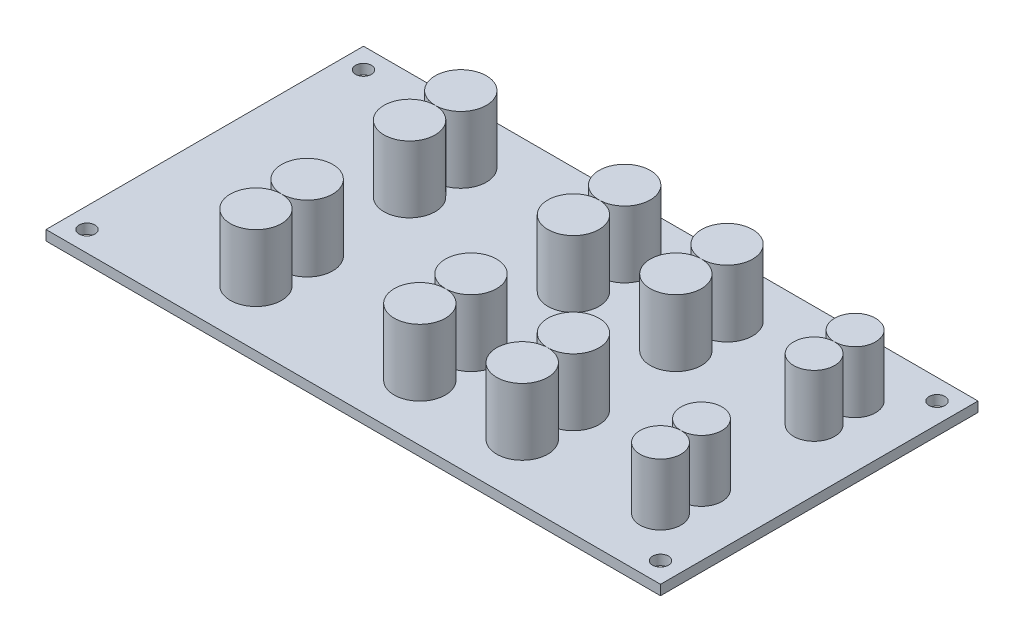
ISO-10303-21;
HEADER;
FILE_DESCRIPTION(('STEP AP214'),'2;1');
FILE_NAME('part.step','',(''),(''),'','','');
FILE_SCHEMA(('AUTOMOTIVE_DESIGN { 1 0 10303 214 1 1 1 1 }'));
ENDSEC;
DATA;
#1=APPLICATION_CONTEXT('core data for automotive mechanical design processes');
#2=APPLICATION_PROTOCOL_DEFINITION('international standard','automotive_design',2000,#1);
#3=PRODUCT_CONTEXT('',#1,'mechanical');
#4=PRODUCT('Part','Part','',(#3));
#5=PRODUCT_RELATED_PRODUCT_CATEGORY('part','',(#4));
#6=PRODUCT_DEFINITION_FORMATION('','',#4);
#7=PRODUCT_DEFINITION_CONTEXT('part definition',#1,'design');
#8=PRODUCT_DEFINITION('design','',#6,#7);
#9=PRODUCT_DEFINITION_SHAPE('','',#8);
#10=(LENGTH_UNIT() NAMED_UNIT(*) SI_UNIT(.MILLI.,.METRE.));
#11=(NAMED_UNIT(*) PLANE_ANGLE_UNIT() SI_UNIT($,.RADIAN.));
#12=(NAMED_UNIT(*) SI_UNIT($,.STERADIAN.) SOLID_ANGLE_UNIT());
#13=UNCERTAINTY_MEASURE_WITH_UNIT(LENGTH_MEASURE(1.E-05),#10,'distance_accuracy_value','');
#14=(GEOMETRIC_REPRESENTATION_CONTEXT(3) GLOBAL_UNCERTAINTY_ASSIGNED_CONTEXT((#13)) GLOBAL_UNIT_ASSIGNED_CONTEXT((#10,
#11,#12)) REPRESENTATION_CONTEXT('',''));
#15=CARTESIAN_POINT('',(0.,0.,0.));
#16=DIRECTION('',(0.,0.,1.));
#17=DIRECTION('',(1.,0.,0.));
#18=AXIS2_PLACEMENT_3D('',#15,#16,#17);
#19=CARTESIAN_POINT('',(48.,13.95,19.));
#20=DIRECTION('',(0.,-1.,0.));
#21=DIRECTION('',(0.,0.,-1.));
#22=AXIS2_PLACEMENT_3D('',#19,#20,#21);
#23=CYLINDRICAL_SURFACE('',#22,4.00000000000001);
#24=CARTESIAN_POINT('',(48.,13.95,19.));
#25=DIRECTION('',(0.,1.,0.));
#26=DIRECTION('',(0.,0.,1.));
#27=AXIS2_PLACEMENT_3D('',#24,#25,#26);
#28=CIRCLE('',#27,4.00000000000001);
#29=CARTESIAN_POINT('',(48.,13.95,23.));
#30=VERTEX_POINT('',#29);
#31=EDGE_CURVE('E12',#30,#30,#28,.T.);
#32=ORIENTED_EDGE('',*,*,#31,.F.);
#33=EDGE_LOOP('',(#32));
#34=FACE_BOUND('',#33,.T.);
#35=CARTESIAN_POINT('',(48.,1.95,19.));
#36=DIRECTION('',(0.,1.,0.));
#37=DIRECTION('',(0.,0.,1.));
#38=AXIS2_PLACEMENT_3D('',#35,#36,#37);
#39=CIRCLE('',#38,4.00000000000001);
#40=CARTESIAN_POINT('',(48.,1.95,23.));
#41=VERTEX_POINT('',#40);
#42=EDGE_CURVE('E71',#41,#41,#39,.T.);
#43=ORIENTED_EDGE('',*,*,#42,.T.);
#44=EDGE_LOOP('',(#43));
#45=FACE_BOUND('',#44,.T.);
#46=ADVANCED_FACE('F68',(#34,#45),#23,.T.);
#47=CARTESIAN_POINT('',(0.,13.95,0.));
#48=DIRECTION('',(0.,1.,0.));
#49=DIRECTION('',(0.,0.,1.));
#50=AXIS2_PLACEMENT_3D('',#47,#48,#49);
#51=PLANE('',#50);
#52=ORIENTED_EDGE('',*,*,#31,.T.);
#53=EDGE_LOOP('',(#52));
#54=FACE_BOUND('',#53,.T.);
#55=ADVANCED_FACE('F83',(#54),#51,.T.);
#56=CARTESIAN_POINT('',(0.,1.95,0.));
#57=DIRECTION('',(0.,1.,0.));
#58=DIRECTION('',(0.,0.,1.));
#59=AXIS2_PLACEMENT_3D('',#56,#57,#58);
#60=PLANE('',#59);
#61=ORIENTED_EDGE('',*,*,#42,.F.);
#62=EDGE_LOOP('',(#61));
#63=FACE_BOUND('',#62,.T.);
#64=ADVANCED_FACE('F81',(#63),#60,.F.);
#65=CLOSED_SHELL('',(#46,#55,#64));
#66=MANIFOLD_SOLID_BREP('B2',#65);
#67=CARTESIAN_POINT('',(48.,13.95,11.));
#68=DIRECTION('',(0.,-1.,0.));
#69=DIRECTION('',(0.,0.,-1.));
#70=AXIS2_PLACEMENT_3D('',#67,#68,#69);
#71=CYLINDRICAL_SURFACE('',#70,4.00000000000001);
#72=CARTESIAN_POINT('',(48.,13.95,11.));
#73=DIRECTION('',(0.,1.,0.));
#74=DIRECTION('',(0.,0.,1.));
#75=AXIS2_PLACEMENT_3D('',#72,#73,#74);
#76=CIRCLE('',#75,4.00000000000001);
#77=CARTESIAN_POINT('',(48.,13.95,15.));
#78=VERTEX_POINT('',#77);
#79=EDGE_CURVE('E67',#78,#78,#76,.T.);
#80=ORIENTED_EDGE('',*,*,#79,.F.);
#81=EDGE_LOOP('',(#80));
#82=FACE_BOUND('',#81,.T.);
#83=CARTESIAN_POINT('',(48.,1.95,11.));
#84=DIRECTION('',(0.,1.,0.));
#85=DIRECTION('',(0.,0.,1.));
#86=AXIS2_PLACEMENT_3D('',#83,#84,#85);
#87=CIRCLE('',#86,4.00000000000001);
#88=CARTESIAN_POINT('',(48.,1.95,15.));
#89=VERTEX_POINT('',#88);
#90=EDGE_CURVE('E120',#89,#89,#87,.T.);
#91=ORIENTED_EDGE('',*,*,#90,.T.);
#92=EDGE_LOOP('',(#91));
#93=FACE_BOUND('',#92,.T.);
#94=ADVANCED_FACE('F117',(#82,#93),#71,.T.);
#95=CARTESIAN_POINT('',(0.,13.95,0.));
#96=DIRECTION('',(0.,1.,0.));
#97=DIRECTION('',(0.,0.,1.));
#98=AXIS2_PLACEMENT_3D('',#95,#96,#97);
#99=PLANE('',#98);
#100=ORIENTED_EDGE('',*,*,#79,.T.);
#101=EDGE_LOOP('',(#100));
#102=FACE_BOUND('',#101,.T.);
#103=ADVANCED_FACE('F132',(#102),#99,.T.);
#104=CARTESIAN_POINT('',(0.,1.95,0.));
#105=DIRECTION('',(0.,1.,0.));
#106=DIRECTION('',(0.,0.,1.));
#107=AXIS2_PLACEMENT_3D('',#104,#105,#106);
#108=PLANE('',#107);
#109=ORIENTED_EDGE('',*,*,#90,.F.);
#110=EDGE_LOOP('',(#109));
#111=FACE_BOUND('',#110,.T.);
#112=ADVANCED_FACE('F130',(#111),#108,.F.);
#113=CLOSED_SHELL('',(#94,#103,#112));
#114=MANIFOLD_SOLID_BREP('B7',#113);
#115=CARTESIAN_POINT('',(48.,13.95,-19.));
#116=DIRECTION('',(0.,-1.,0.));
#117=DIRECTION('',(0.,0.,-1.));
#118=AXIS2_PLACEMENT_3D('',#115,#116,#117);
#119=CYLINDRICAL_SURFACE('',#118,4.00000000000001);
#120=CARTESIAN_POINT('',(48.,13.95,-19.));
#121=DIRECTION('',(0.,1.,0.));
#122=DIRECTION('',(0.,0.,1.));
#123=AXIS2_PLACEMENT_3D('',#120,#121,#122);
#124=CIRCLE('',#123,4.00000000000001);
#125=CARTESIAN_POINT('',(48.,13.95,-15.));
#126=VERTEX_POINT('',#125);
#127=EDGE_CURVE('E116',#126,#126,#124,.T.);
#128=ORIENTED_EDGE('',*,*,#127,.F.);
#129=EDGE_LOOP('',(#128));
#130=FACE_BOUND('',#129,.T.);
#131=CARTESIAN_POINT('',(48.,1.95,-19.));
#132=DIRECTION('',(0.,1.,0.));
#133=DIRECTION('',(0.,0.,1.));
#134=AXIS2_PLACEMENT_3D('',#131,#132,#133);
#135=CIRCLE('',#134,4.00000000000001);
#136=CARTESIAN_POINT('',(48.,1.95,-15.));
#137=VERTEX_POINT('',#136);
#138=EDGE_CURVE('E169',#137,#137,#135,.T.);
#139=ORIENTED_EDGE('',*,*,#138,.T.);
#140=EDGE_LOOP('',(#139));
#141=FACE_BOUND('',#140,.T.);
#142=ADVANCED_FACE('F166',(#130,#141),#119,.T.);
#143=CARTESIAN_POINT('',(0.,13.95,0.));
#144=DIRECTION('',(0.,1.,0.));
#145=DIRECTION('',(0.,0.,1.));
#146=AXIS2_PLACEMENT_3D('',#143,#144,#145);
#147=PLANE('',#146);
#148=ORIENTED_EDGE('',*,*,#127,.T.);
#149=EDGE_LOOP('',(#148));
#150=FACE_BOUND('',#149,.T.);
#151=ADVANCED_FACE('F181',(#150),#147,.T.);
#152=CARTESIAN_POINT('',(0.,1.95,0.));
#153=DIRECTION('',(0.,1.,0.));
#154=DIRECTION('',(0.,0.,1.));
#155=AXIS2_PLACEMENT_3D('',#152,#153,#154);
#156=PLANE('',#155);
#157=ORIENTED_EDGE('',*,*,#138,.F.);
#158=EDGE_LOOP('',(#157));
#159=FACE_BOUND('',#158,.T.);
#160=ADVANCED_FACE('F179',(#159),#156,.F.);
#161=CLOSED_SHELL('',(#142,#151,#160));
#162=MANIFOLD_SOLID_BREP('B62',#161);
#163=CARTESIAN_POINT('',(48.,13.95,-11.));
#164=DIRECTION('',(0.,-1.,0.));
#165=DIRECTION('',(0.,0.,-1.));
#166=AXIS2_PLACEMENT_3D('',#163,#164,#165);
#167=CYLINDRICAL_SURFACE('',#166,4.00000000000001);
#168=CARTESIAN_POINT('',(48.,13.95,-11.));
#169=DIRECTION('',(0.,1.,0.));
#170=DIRECTION('',(0.,0.,1.));
#171=AXIS2_PLACEMENT_3D('',#168,#169,#170);
#172=CIRCLE('',#171,4.00000000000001);
#173=CARTESIAN_POINT('',(48.,13.95,-6.99999999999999));
#174=VERTEX_POINT('',#173);
#175=EDGE_CURVE('E165',#174,#174,#172,.T.);
#176=ORIENTED_EDGE('',*,*,#175,.F.);
#177=EDGE_LOOP('',(#176));
#178=FACE_BOUND('',#177,.T.);
#179=CARTESIAN_POINT('',(48.,1.95,-11.));
#180=DIRECTION('',(0.,1.,0.));
#181=DIRECTION('',(0.,0.,1.));
#182=AXIS2_PLACEMENT_3D('',#179,#180,#181);
#183=CIRCLE('',#182,4.00000000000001);
#184=CARTESIAN_POINT('',(48.,1.95,-6.99999999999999));
#185=VERTEX_POINT('',#184);
#186=EDGE_CURVE('E218',#185,#185,#183,.T.);
#187=ORIENTED_EDGE('',*,*,#186,.T.);
#188=EDGE_LOOP('',(#187));
#189=FACE_BOUND('',#188,.T.);
#190=ADVANCED_FACE('F215',(#178,#189),#167,.T.);
#191=CARTESIAN_POINT('',(0.,13.95,0.));
#192=DIRECTION('',(0.,1.,0.));
#193=DIRECTION('',(0.,0.,1.));
#194=AXIS2_PLACEMENT_3D('',#191,#192,#193);
#195=PLANE('',#194);
#196=ORIENTED_EDGE('',*,*,#175,.T.);
#197=EDGE_LOOP('',(#196));
#198=FACE_BOUND('',#197,.T.);
#199=ADVANCED_FACE('F230',(#198),#195,.T.);
#200=CARTESIAN_POINT('',(0.,1.95,0.));
#201=DIRECTION('',(0.,1.,0.));
#202=DIRECTION('',(0.,0.,1.));
#203=AXIS2_PLACEMENT_3D('',#200,#201,#202);
#204=PLANE('',#203);
#205=ORIENTED_EDGE('',*,*,#186,.F.);
#206=EDGE_LOOP('',(#205));
#207=FACE_BOUND('',#206,.T.);
#208=ADVANCED_FACE('F228',(#207),#204,.F.);
#209=CLOSED_SHELL('',(#190,#199,#208));
#210=MANIFOLD_SOLID_BREP('B111',#209);
#211=CARTESIAN_POINT('',(22.,14.95,20.));
#212=DIRECTION('',(0.,-1.,0.));
#213=DIRECTION('',(0.,0.,-1.));
#214=AXIS2_PLACEMENT_3D('',#211,#212,#213);
#215=CYLINDRICAL_SURFACE('',#214,5.);
#216=CARTESIAN_POINT('',(22.,14.95,20.));
#217=DIRECTION('',(0.,1.,0.));
#218=DIRECTION('',(0.,0.,1.));
#219=AXIS2_PLACEMENT_3D('',#216,#217,#218);
#220=CIRCLE('',#219,5.);
#221=CARTESIAN_POINT('',(22.,14.95,15.));
#222=VERTEX_POINT('',#221);
#223=EDGE_CURVE('E214',#222,#222,#220,.T.);
#224=CARTESIAN_POINT('',(22.,1.95,20.));
#225=DIRECTION('',(0.,1.,0.));
#226=DIRECTION('',(0.,0.,1.));
#227=AXIS2_PLACEMENT_3D('',#224,#225,#226);
#228=CIRCLE('',#227,5.);
#229=CARTESIAN_POINT('',(22.,1.95,15.));
#230=VERTEX_POINT('',#229);
#231=EDGE_CURVE('E267',#230,#230,#228,.T.);
#232=CARTESIAN_POINT('',(22.,14.95,15.));
#233=CARTESIAN_POINT('',(22.,14.8145833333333,15.));
#234=CARTESIAN_POINT('',(22.,14.6791666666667,15.));
#235=CARTESIAN_POINT('',(22.,14.4083333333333,15.));
#236=CARTESIAN_POINT('',(22.,14.2729166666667,15.));
#237=CARTESIAN_POINT('',(22.,14.0020833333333,15.));
#238=CARTESIAN_POINT('',(22.,13.8666666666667,15.));
#239=CARTESIAN_POINT('',(22.,13.5958333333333,15.));
#240=CARTESIAN_POINT('',(22.,13.4604166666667,15.));
#241=CARTESIAN_POINT('',(22.,13.1895833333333,15.));
#242=CARTESIAN_POINT('',(22.,13.0541666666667,15.));
#243=CARTESIAN_POINT('',(22.,12.7833333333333,15.));
#244=CARTESIAN_POINT('',(22.,12.6479166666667,15.));
#245=CARTESIAN_POINT('',(22.,12.3770833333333,15.));
#246=CARTESIAN_POINT('',(22.,12.2416666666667,15.));
#247=CARTESIAN_POINT('',(22.,11.9708333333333,15.));
#248=CARTESIAN_POINT('',(22.,11.8354166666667,15.));
#249=CARTESIAN_POINT('',(22.,11.5645833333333,15.));
#250=CARTESIAN_POINT('',(22.,11.4291666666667,15.));
#251=CARTESIAN_POINT('',(22.,11.1583333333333,15.));
#252=CARTESIAN_POINT('',(22.,11.0229166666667,15.));
#253=CARTESIAN_POINT('',(22.,10.7520833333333,15.));
#254=CARTESIAN_POINT('',(22.,10.6166666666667,15.));
#255=CARTESIAN_POINT('',(22.,10.3458333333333,15.));
#256=CARTESIAN_POINT('',(22.,10.2104166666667,15.));
#257=CARTESIAN_POINT('',(22.,9.93958333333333,15.));
#258=CARTESIAN_POINT('',(22.,9.80416666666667,15.));
#259=CARTESIAN_POINT('',(22.,9.53333333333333,15.));
#260=CARTESIAN_POINT('',(22.,9.39791666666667,15.));
#261=CARTESIAN_POINT('',(22.,9.12708333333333,15.));
#262=CARTESIAN_POINT('',(22.,8.99166666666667,15.));
#263=CARTESIAN_POINT('',(22.,8.72083333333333,15.));
#264=CARTESIAN_POINT('',(22.,8.58541666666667,15.));
#265=CARTESIAN_POINT('',(22.,8.31458333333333,15.));
#266=CARTESIAN_POINT('',(22.,8.17916666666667,15.));
#267=CARTESIAN_POINT('',(22.,7.90833333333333,15.));
#268=CARTESIAN_POINT('',(22.,7.77291666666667,15.));
#269=CARTESIAN_POINT('',(22.,7.50208333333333,15.));
#270=CARTESIAN_POINT('',(22.,7.36666666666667,15.));
#271=CARTESIAN_POINT('',(22.,7.09583333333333,15.));
#272=CARTESIAN_POINT('',(22.,6.96041666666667,15.));
#273=CARTESIAN_POINT('',(22.,6.68958333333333,15.));
#274=CARTESIAN_POINT('',(22.,6.55416666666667,15.));
#275=CARTESIAN_POINT('',(22.,6.28333333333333,15.));
#276=CARTESIAN_POINT('',(22.,6.14791666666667,15.));
#277=CARTESIAN_POINT('',(22.,5.87708333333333,15.));
#278=CARTESIAN_POINT('',(22.,5.74166666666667,15.));
#279=CARTESIAN_POINT('',(22.,5.47083333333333,15.));
#280=CARTESIAN_POINT('',(22.,5.33541666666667,15.));
#281=CARTESIAN_POINT('',(22.,5.06458333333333,15.));
#282=CARTESIAN_POINT('',(22.,4.92916666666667,15.));
#283=CARTESIAN_POINT('',(22.,4.65833333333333,15.));
#284=CARTESIAN_POINT('',(22.,4.52291666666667,15.));
#285=CARTESIAN_POINT('',(22.,4.25208333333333,15.));
#286=CARTESIAN_POINT('',(22.,4.11666666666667,15.));
#287=CARTESIAN_POINT('',(22.,3.84583333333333,15.));
#288=CARTESIAN_POINT('',(22.,3.71041666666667,15.));
#289=CARTESIAN_POINT('',(22.,3.43958333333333,15.));
#290=CARTESIAN_POINT('',(22.,3.30416666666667,15.));
#291=CARTESIAN_POINT('',(22.,3.03333333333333,15.));
#292=CARTESIAN_POINT('',(22.,2.89791666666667,15.));
#293=CARTESIAN_POINT('',(22.,2.62708333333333,15.));
#294=CARTESIAN_POINT('',(22.,2.49166666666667,15.));
#295=CARTESIAN_POINT('',(22.,2.22083333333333,15.));
#296=CARTESIAN_POINT('',(22.,2.08541666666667,15.));
#297=CARTESIAN_POINT('',(22.,1.95,15.));
#298=B_SPLINE_CURVE_WITH_KNOTS('',3,(#232,#233,#234,#235,#236,#237,#238,#239,#240,#241,#242,
#243,#244,#245,#246,#247,#248,#249,#250,#251,#252,#253,#254,#255,#256,#257,#258,#259,#260,#261,
#262,#263,#264,#265,#266,#267,#268,#269,#270,#271,#272,#273,#274,#275,#276,#277,#278,#279,#280,
#281,#282,#283,#284,#285,#286,#287,#288,#289,#290,#291,#292,#293,#294,#295,#296,#297),
.UNSPECIFIED.,.F.,.F.,(4,2,2,2,2,2,2,2,2,2,2,2,2,2,2,2,2,2,2,2,2,2,2,2,2,2,2,2,2,2,2,2,4),(0.,
0.406249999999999,0.812499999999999,1.21875,1.625,2.03125,2.4375,2.84375,3.25,3.65625,4.0625,
4.46875,4.875,5.28125,5.6875,6.09375,6.5,6.90625,7.3125,7.71875,8.125,8.53125,8.9375,9.34375,
9.75,10.15625,10.5625,10.96875,11.375,11.78125,12.1875,12.59375,13.),.UNSPECIFIED.);
#299=EDGE_CURVE('BSEAM264',#222,#230,#298,.T.);
#300=ORIENTED_EDGE('',*,*,#223,.F.);
#301=ORIENTED_EDGE('',*,*,#231,.T.);
#302=ORIENTED_EDGE('',*,*,#299,.T.);
#303=ORIENTED_EDGE('',*,*,#299,.F.);
#304=EDGE_LOOP('',(#300,#302,#301,#303));
#305=FACE_BOUND('',#304,.T.);
#306=ADVANCED_FACE('F264',(#305),#215,.T.);
#307=CARTESIAN_POINT('',(0.,14.95,0.));
#308=DIRECTION('',(0.,1.,0.));
#309=DIRECTION('',(0.,0.,1.));
#310=AXIS2_PLACEMENT_3D('',#307,#308,#309);
#311=PLANE('',#310);
#312=ORIENTED_EDGE('',*,*,#223,.T.);
#313=EDGE_LOOP('',(#312));
#314=FACE_BOUND('',#313,.T.);
#315=ADVANCED_FACE('F279',(#314),#311,.T.);
#316=CARTESIAN_POINT('',(0.,1.95,0.));
#317=DIRECTION('',(0.,1.,0.));
#318=DIRECTION('',(0.,0.,1.));
#319=AXIS2_PLACEMENT_3D('',#316,#317,#318);
#320=PLANE('',#319);
#321=ORIENTED_EDGE('',*,*,#231,.F.);
#322=EDGE_LOOP('',(#321));
#323=FACE_BOUND('',#322,.T.);
#324=ADVANCED_FACE('F277',(#323),#320,.F.);
#325=CLOSED_SHELL('',(#306,#315,#324));
#326=MANIFOLD_SOLID_BREP('B160',#325);
#327=CARTESIAN_POINT('',(22.,14.95,10.));
#328=DIRECTION('',(0.,-1.,0.));
#329=DIRECTION('',(0.,0.,-1.));
#330=AXIS2_PLACEMENT_3D('',#327,#328,#329);
#331=CYLINDRICAL_SURFACE('',#330,5.);
#332=CARTESIAN_POINT('',(22.,14.95,10.));
#333=DIRECTION('',(0.,1.,0.));
#334=DIRECTION('',(0.,0.,1.));
#335=AXIS2_PLACEMENT_3D('',#332,#333,#334);
#336=CIRCLE('',#335,5.);
#337=CARTESIAN_POINT('',(22.,14.95,5.));
#338=VERTEX_POINT('',#337);
#339=EDGE_CURVE('E263',#338,#338,#336,.T.);
#340=CARTESIAN_POINT('',(22.,1.95,10.));
#341=DIRECTION('',(0.,1.,0.));
#342=DIRECTION('',(0.,0.,1.));
#343=AXIS2_PLACEMENT_3D('',#340,#341,#342);
#344=CIRCLE('',#343,5.);
#345=CARTESIAN_POINT('',(22.,1.95,5.));
#346=VERTEX_POINT('',#345);
#347=EDGE_CURVE('E316',#346,#346,#344,.T.);
#348=CARTESIAN_POINT('',(22.,14.95,5.));
#349=CARTESIAN_POINT('',(22.,14.8145833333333,5.));
#350=CARTESIAN_POINT('',(22.,14.6791666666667,5.));
#351=CARTESIAN_POINT('',(22.,14.4083333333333,5.));
#352=CARTESIAN_POINT('',(22.,14.2729166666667,5.));
#353=CARTESIAN_POINT('',(22.,14.0020833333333,5.));
#354=CARTESIAN_POINT('',(22.,13.8666666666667,5.));
#355=CARTESIAN_POINT('',(22.,13.5958333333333,5.));
#356=CARTESIAN_POINT('',(22.,13.4604166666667,5.));
#357=CARTESIAN_POINT('',(22.,13.1895833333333,5.));
#358=CARTESIAN_POINT('',(22.,13.0541666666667,5.));
#359=CARTESIAN_POINT('',(22.,12.7833333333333,5.));
#360=CARTESIAN_POINT('',(22.,12.6479166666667,5.));
#361=CARTESIAN_POINT('',(22.,12.3770833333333,5.));
#362=CARTESIAN_POINT('',(22.,12.2416666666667,5.));
#363=CARTESIAN_POINT('',(22.,11.9708333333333,5.));
#364=CARTESIAN_POINT('',(22.,11.8354166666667,5.));
#365=CARTESIAN_POINT('',(22.,11.5645833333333,5.));
#366=CARTESIAN_POINT('',(22.,11.4291666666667,5.));
#367=CARTESIAN_POINT('',(22.,11.1583333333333,5.));
#368=CARTESIAN_POINT('',(22.,11.0229166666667,5.));
#369=CARTESIAN_POINT('',(22.,10.7520833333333,5.));
#370=CARTESIAN_POINT('',(22.,10.6166666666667,5.));
#371=CARTESIAN_POINT('',(22.,10.3458333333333,5.));
#372=CARTESIAN_POINT('',(22.,10.2104166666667,5.));
#373=CARTESIAN_POINT('',(22.,9.93958333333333,5.));
#374=CARTESIAN_POINT('',(22.,9.80416666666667,5.));
#375=CARTESIAN_POINT('',(22.,9.53333333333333,5.));
#376=CARTESIAN_POINT('',(22.,9.39791666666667,5.));
#377=CARTESIAN_POINT('',(22.,9.12708333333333,5.));
#378=CARTESIAN_POINT('',(22.,8.99166666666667,5.));
#379=CARTESIAN_POINT('',(22.,8.72083333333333,5.));
#380=CARTESIAN_POINT('',(22.,8.58541666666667,5.));
#381=CARTESIAN_POINT('',(22.,8.31458333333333,5.));
#382=CARTESIAN_POINT('',(22.,8.17916666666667,5.));
#383=CARTESIAN_POINT('',(22.,7.90833333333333,5.));
#384=CARTESIAN_POINT('',(22.,7.77291666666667,5.));
#385=CARTESIAN_POINT('',(22.,7.50208333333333,5.));
#386=CARTESIAN_POINT('',(22.,7.36666666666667,5.));
#387=CARTESIAN_POINT('',(22.,7.09583333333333,5.));
#388=CARTESIAN_POINT('',(22.,6.96041666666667,5.));
#389=CARTESIAN_POINT('',(22.,6.68958333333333,5.));
#390=CARTESIAN_POINT('',(22.,6.55416666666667,5.));
#391=CARTESIAN_POINT('',(22.,6.28333333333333,5.));
#392=CARTESIAN_POINT('',(22.,6.14791666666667,5.));
#393=CARTESIAN_POINT('',(22.,5.87708333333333,5.));
#394=CARTESIAN_POINT('',(22.,5.74166666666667,5.));
#395=CARTESIAN_POINT('',(22.,5.47083333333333,5.));
#396=CARTESIAN_POINT('',(22.,5.33541666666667,5.));
#397=CARTESIAN_POINT('',(22.,5.06458333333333,5.));
#398=CARTESIAN_POINT('',(22.,4.92916666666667,5.));
#399=CARTESIAN_POINT('',(22.,4.65833333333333,5.));
#400=CARTESIAN_POINT('',(22.,4.52291666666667,5.));
#401=CARTESIAN_POINT('',(22.,4.25208333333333,5.));
#402=CARTESIAN_POINT('',(22.,4.11666666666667,5.));
#403=CARTESIAN_POINT('',(22.,3.84583333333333,5.));
#404=CARTESIAN_POINT('',(22.,3.71041666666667,5.));
#405=CARTESIAN_POINT('',(22.,3.43958333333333,5.));
#406=CARTESIAN_POINT('',(22.,3.30416666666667,5.));
#407=CARTESIAN_POINT('',(22.,3.03333333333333,5.));
#408=CARTESIAN_POINT('',(22.,2.89791666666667,5.));
#409=CARTESIAN_POINT('',(22.,2.62708333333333,5.));
#410=CARTESIAN_POINT('',(22.,2.49166666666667,5.));
#411=CARTESIAN_POINT('',(22.,2.22083333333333,5.));
#412=CARTESIAN_POINT('',(22.,2.08541666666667,5.));
#413=CARTESIAN_POINT('',(22.,1.95,5.));
#414=B_SPLINE_CURVE_WITH_KNOTS('',3,(#348,#349,#350,#351,#352,#353,#354,#355,#356,#357,#358,
#359,#360,#361,#362,#363,#364,#365,#366,#367,#368,#369,#370,#371,#372,#373,#374,#375,#376,#377,
#378,#379,#380,#381,#382,#383,#384,#385,#386,#387,#388,#389,#390,#391,#392,#393,#394,#395,#396,
#397,#398,#399,#400,#401,#402,#403,#404,#405,#406,#407,#408,#409,#410,#411,#412,#413),
.UNSPECIFIED.,.F.,.F.,(4,2,2,2,2,2,2,2,2,2,2,2,2,2,2,2,2,2,2,2,2,2,2,2,2,2,2,2,2,2,2,2,4),(0.,
0.406249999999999,0.812499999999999,1.21875,1.625,2.03125,2.4375,2.84375,3.25,3.65625,4.0625,
4.46875,4.875,5.28125,5.6875,6.09375,6.5,6.90625,7.3125,7.71875,8.125,8.53125,8.9375,9.34375,
9.75,10.15625,10.5625,10.96875,11.375,11.78125,12.1875,12.59375,13.),.UNSPECIFIED.);
#415=EDGE_CURVE('BSEAM313',#338,#346,#414,.T.);
#416=ORIENTED_EDGE('',*,*,#339,.F.);
#417=ORIENTED_EDGE('',*,*,#347,.T.);
#418=ORIENTED_EDGE('',*,*,#415,.T.);
#419=ORIENTED_EDGE('',*,*,#415,.F.);
#420=EDGE_LOOP('',(#416,#418,#417,#419));
#421=FACE_BOUND('',#420,.T.);
#422=ADVANCED_FACE('F313',(#421),#331,.T.);
#423=CARTESIAN_POINT('',(0.,14.95,0.));
#424=DIRECTION('',(0.,1.,0.));
#425=DIRECTION('',(0.,0.,1.));
#426=AXIS2_PLACEMENT_3D('',#423,#424,#425);
#427=PLANE('',#426);
#428=ORIENTED_EDGE('',*,*,#339,.T.);
#429=EDGE_LOOP('',(#428));
#430=FACE_BOUND('',#429,.T.);
#431=ADVANCED_FACE('F328',(#430),#427,.T.);
#432=CARTESIAN_POINT('',(0.,1.95,0.));
#433=DIRECTION('',(0.,1.,0.));
#434=DIRECTION('',(0.,0.,1.));
#435=AXIS2_PLACEMENT_3D('',#432,#433,#434);
#436=PLANE('',#435);
#437=ORIENTED_EDGE('',*,*,#347,.F.);
#438=EDGE_LOOP('',(#437));
#439=FACE_BOUND('',#438,.T.);
#440=ADVANCED_FACE('F326',(#439),#436,.F.);
#441=CLOSED_SHELL('',(#422,#431,#440));
#442=MANIFOLD_SOLID_BREP('B209',#441);
#443=CARTESIAN_POINT('',(22.,14.95,-10.));
#444=DIRECTION('',(0.,-1.,0.));
#445=DIRECTION('',(0.,0.,-1.));
#446=AXIS2_PLACEMENT_3D('',#443,#444,#445);
#447=CYLINDRICAL_SURFACE('',#446,5.);
#448=CARTESIAN_POINT('',(22.,14.95,-10.));
#449=DIRECTION('',(0.,1.,0.));
#450=DIRECTION('',(0.,0.,1.));
#451=AXIS2_PLACEMENT_3D('',#448,#449,#450);
#452=CIRCLE('',#451,5.);
#453=CARTESIAN_POINT('',(22.,14.95,-15.));
#454=VERTEX_POINT('',#453);
#455=EDGE_CURVE('E312',#454,#454,#452,.T.);
#456=CARTESIAN_POINT('',(22.,1.95,-10.));
#457=DIRECTION('',(0.,1.,0.));
#458=DIRECTION('',(0.,0.,1.));
#459=AXIS2_PLACEMENT_3D('',#456,#457,#458);
#460=CIRCLE('',#459,5.);
#461=CARTESIAN_POINT('',(22.,1.95,-15.));
#462=VERTEX_POINT('',#461);
#463=EDGE_CURVE('E365',#462,#462,#460,.T.);
#464=CARTESIAN_POINT('',(22.,14.95,-15.));
#465=CARTESIAN_POINT('',(22.,14.8145833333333,-15.));
#466=CARTESIAN_POINT('',(22.,14.6791666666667,-15.));
#467=CARTESIAN_POINT('',(22.,14.4083333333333,-15.));
#468=CARTESIAN_POINT('',(22.,14.2729166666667,-15.));
#469=CARTESIAN_POINT('',(22.,14.0020833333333,-15.));
#470=CARTESIAN_POINT('',(22.,13.8666666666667,-15.));
#471=CARTESIAN_POINT('',(22.,13.5958333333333,-15.));
#472=CARTESIAN_POINT('',(22.,13.4604166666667,-15.));
#473=CARTESIAN_POINT('',(22.,13.1895833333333,-15.));
#474=CARTESIAN_POINT('',(22.,13.0541666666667,-15.));
#475=CARTESIAN_POINT('',(22.,12.7833333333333,-15.));
#476=CARTESIAN_POINT('',(22.,12.6479166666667,-15.));
#477=CARTESIAN_POINT('',(22.,12.3770833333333,-15.));
#478=CARTESIAN_POINT('',(22.,12.2416666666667,-15.));
#479=CARTESIAN_POINT('',(22.,11.9708333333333,-15.));
#480=CARTESIAN_POINT('',(22.,11.8354166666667,-15.));
#481=CARTESIAN_POINT('',(22.,11.5645833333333,-15.));
#482=CARTESIAN_POINT('',(22.,11.4291666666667,-15.));
#483=CARTESIAN_POINT('',(22.,11.1583333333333,-15.));
#484=CARTESIAN_POINT('',(22.,11.0229166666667,-15.));
#485=CARTESIAN_POINT('',(22.,10.7520833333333,-15.));
#486=CARTESIAN_POINT('',(22.,10.6166666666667,-15.));
#487=CARTESIAN_POINT('',(22.,10.3458333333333,-15.));
#488=CARTESIAN_POINT('',(22.,10.2104166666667,-15.));
#489=CARTESIAN_POINT('',(22.,9.93958333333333,-15.));
#490=CARTESIAN_POINT('',(22.,9.80416666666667,-15.));
#491=CARTESIAN_POINT('',(22.,9.53333333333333,-15.));
#492=CARTESIAN_POINT('',(22.,9.39791666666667,-15.));
#493=CARTESIAN_POINT('',(22.,9.12708333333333,-15.));
#494=CARTESIAN_POINT('',(22.,8.99166666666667,-15.));
#495=CARTESIAN_POINT('',(22.,8.72083333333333,-15.));
#496=CARTESIAN_POINT('',(22.,8.58541666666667,-15.));
#497=CARTESIAN_POINT('',(22.,8.31458333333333,-15.));
#498=CARTESIAN_POINT('',(22.,8.17916666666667,-15.));
#499=CARTESIAN_POINT('',(22.,7.90833333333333,-15.));
#500=CARTESIAN_POINT('',(22.,7.77291666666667,-15.));
#501=CARTESIAN_POINT('',(22.,7.50208333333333,-15.));
#502=CARTESIAN_POINT('',(22.,7.36666666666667,-15.));
#503=CARTESIAN_POINT('',(22.,7.09583333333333,-15.));
#504=CARTESIAN_POINT('',(22.,6.96041666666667,-15.));
#505=CARTESIAN_POINT('',(22.,6.68958333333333,-15.));
#506=CARTESIAN_POINT('',(22.,6.55416666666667,-15.));
#507=CARTESIAN_POINT('',(22.,6.28333333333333,-15.));
#508=CARTESIAN_POINT('',(22.,6.14791666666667,-15.));
#509=CARTESIAN_POINT('',(22.,5.87708333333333,-15.));
#510=CARTESIAN_POINT('',(22.,5.74166666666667,-15.));
#511=CARTESIAN_POINT('',(22.,5.47083333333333,-15.));
#512=CARTESIAN_POINT('',(22.,5.33541666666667,-15.));
#513=CARTESIAN_POINT('',(22.,5.06458333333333,-15.));
#514=CARTESIAN_POINT('',(22.,4.92916666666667,-15.));
#515=CARTESIAN_POINT('',(22.,4.65833333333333,-15.));
#516=CARTESIAN_POINT('',(22.,4.52291666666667,-15.));
#517=CARTESIAN_POINT('',(22.,4.25208333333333,-15.));
#518=CARTESIAN_POINT('',(22.,4.11666666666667,-15.));
#519=CARTESIAN_POINT('',(22.,3.84583333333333,-15.));
#520=CARTESIAN_POINT('',(22.,3.71041666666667,-15.));
#521=CARTESIAN_POINT('',(22.,3.43958333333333,-15.));
#522=CARTESIAN_POINT('',(22.,3.30416666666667,-15.));
#523=CARTESIAN_POINT('',(22.,3.03333333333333,-15.));
#524=CARTESIAN_POINT('',(22.,2.89791666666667,-15.));
#525=CARTESIAN_POINT('',(22.,2.62708333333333,-15.));
#526=CARTESIAN_POINT('',(22.,2.49166666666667,-15.));
#527=CARTESIAN_POINT('',(22.,2.22083333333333,-15.));
#528=CARTESIAN_POINT('',(22.,2.08541666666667,-15.));
#529=CARTESIAN_POINT('',(22.,1.95,-15.));
#530=B_SPLINE_CURVE_WITH_KNOTS('',3,(#464,#465,#466,#467,#468,#469,#470,#471,#472,#473,#474,
#475,#476,#477,#478,#479,#480,#481,#482,#483,#484,#485,#486,#487,#488,#489,#490,#491,#492,#493,
#494,#495,#496,#497,#498,#499,#500,#501,#502,#503,#504,#505,#506,#507,#508,#509,#510,#511,#512,
#513,#514,#515,#516,#517,#518,#519,#520,#521,#522,#523,#524,#525,#526,#527,#528,#529),
.UNSPECIFIED.,.F.,.F.,(4,2,2,2,2,2,2,2,2,2,2,2,2,2,2,2,2,2,2,2,2,2,2,2,2,2,2,2,2,2,2,2,4),(0.,
0.406249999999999,0.812499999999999,1.21875,1.625,2.03125,2.4375,2.84375,3.25,3.65625,4.0625,
4.46875,4.875,5.28125,5.6875,6.09375,6.5,6.90625,7.3125,7.71875,8.125,8.53125,8.9375,9.34375,
9.75,10.15625,10.5625,10.96875,11.375,11.78125,12.1875,12.59375,13.),.UNSPECIFIED.);
#531=EDGE_CURVE('BSEAM362',#454,#462,#530,.T.);
#532=ORIENTED_EDGE('',*,*,#455,.F.);
#533=ORIENTED_EDGE('',*,*,#463,.T.);
#534=ORIENTED_EDGE('',*,*,#531,.T.);
#535=ORIENTED_EDGE('',*,*,#531,.F.);
#536=EDGE_LOOP('',(#532,#534,#533,#535));
#537=FACE_BOUND('',#536,.T.);
#538=ADVANCED_FACE('F362',(#537),#447,.T.);
#539=CARTESIAN_POINT('',(0.,14.95,0.));
#540=DIRECTION('',(0.,1.,0.));
#541=DIRECTION('',(0.,0.,1.));
#542=AXIS2_PLACEMENT_3D('',#539,#540,#541);
#543=PLANE('',#542);
#544=ORIENTED_EDGE('',*,*,#455,.T.);
#545=EDGE_LOOP('',(#544));
#546=FACE_BOUND('',#545,.T.);
#547=ADVANCED_FACE('F377',(#546),#543,.T.);
#548=CARTESIAN_POINT('',(0.,1.95,0.));
#549=DIRECTION('',(0.,1.,0.));
#550=DIRECTION('',(0.,0.,1.));
#551=AXIS2_PLACEMENT_3D('',#548,#549,#550);
#552=PLANE('',#551);
#553=ORIENTED_EDGE('',*,*,#463,.F.);
#554=EDGE_LOOP('',(#553));
#555=FACE_BOUND('',#554,.T.);
#556=ADVANCED_FACE('F375',(#555),#552,.F.);
#557=CLOSED_SHELL('',(#538,#547,#556));
#558=MANIFOLD_SOLID_BREP('B258',#557);
#559=CARTESIAN_POINT('',(22.,14.95,-20.));
#560=DIRECTION('',(0.,-1.,0.));
#561=DIRECTION('',(0.,0.,-1.));
#562=AXIS2_PLACEMENT_3D('',#559,#560,#561);
#563=CYLINDRICAL_SURFACE('',#562,5.);
#564=CARTESIAN_POINT('',(22.,14.95,-20.));
#565=DIRECTION('',(0.,1.,0.));
#566=DIRECTION('',(0.,0.,1.));
#567=AXIS2_PLACEMENT_3D('',#564,#565,#566);
#568=CIRCLE('',#567,5.);
#569=CARTESIAN_POINT('',(22.,14.95,-25.));
#570=VERTEX_POINT('',#569);
#571=EDGE_CURVE('E361',#570,#570,#568,.T.);
#572=CARTESIAN_POINT('',(22.,1.95,-20.));
#573=DIRECTION('',(0.,1.,0.));
#574=DIRECTION('',(0.,0.,1.));
#575=AXIS2_PLACEMENT_3D('',#572,#573,#574);
#576=CIRCLE('',#575,5.);
#577=CARTESIAN_POINT('',(22.,1.95,-25.));
#578=VERTEX_POINT('',#577);
#579=EDGE_CURVE('E414',#578,#578,#576,.T.);
#580=CARTESIAN_POINT('',(22.,14.95,-25.));
#581=CARTESIAN_POINT('',(22.,14.8145833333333,-25.));
#582=CARTESIAN_POINT('',(22.,14.6791666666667,-25.));
#583=CARTESIAN_POINT('',(22.,14.4083333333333,-25.));
#584=CARTESIAN_POINT('',(22.,14.2729166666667,-25.));
#585=CARTESIAN_POINT('',(22.,14.0020833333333,-25.));
#586=CARTESIAN_POINT('',(22.,13.8666666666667,-25.));
#587=CARTESIAN_POINT('',(22.,13.5958333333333,-25.));
#588=CARTESIAN_POINT('',(22.,13.4604166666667,-25.));
#589=CARTESIAN_POINT('',(22.,13.1895833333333,-25.));
#590=CARTESIAN_POINT('',(22.,13.0541666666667,-25.));
#591=CARTESIAN_POINT('',(22.,12.7833333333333,-25.));
#592=CARTESIAN_POINT('',(22.,12.6479166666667,-25.));
#593=CARTESIAN_POINT('',(22.,12.3770833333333,-25.));
#594=CARTESIAN_POINT('',(22.,12.2416666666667,-25.));
#595=CARTESIAN_POINT('',(22.,11.9708333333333,-25.));
#596=CARTESIAN_POINT('',(22.,11.8354166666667,-25.));
#597=CARTESIAN_POINT('',(22.,11.5645833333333,-25.));
#598=CARTESIAN_POINT('',(22.,11.4291666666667,-25.));
#599=CARTESIAN_POINT('',(22.,11.1583333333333,-25.));
#600=CARTESIAN_POINT('',(22.,11.0229166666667,-25.));
#601=CARTESIAN_POINT('',(22.,10.7520833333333,-25.));
#602=CARTESIAN_POINT('',(22.,10.6166666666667,-25.));
#603=CARTESIAN_POINT('',(22.,10.3458333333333,-25.));
#604=CARTESIAN_POINT('',(22.,10.2104166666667,-25.));
#605=CARTESIAN_POINT('',(22.,9.93958333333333,-25.));
#606=CARTESIAN_POINT('',(22.,9.80416666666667,-25.));
#607=CARTESIAN_POINT('',(22.,9.53333333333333,-25.));
#608=CARTESIAN_POINT('',(22.,9.39791666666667,-25.));
#609=CARTESIAN_POINT('',(22.,9.12708333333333,-25.));
#610=CARTESIAN_POINT('',(22.,8.99166666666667,-25.));
#611=CARTESIAN_POINT('',(22.,8.72083333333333,-25.));
#612=CARTESIAN_POINT('',(22.,8.58541666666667,-25.));
#613=CARTESIAN_POINT('',(22.,8.31458333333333,-25.));
#614=CARTESIAN_POINT('',(22.,8.17916666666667,-25.));
#615=CARTESIAN_POINT('',(22.,7.90833333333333,-25.));
#616=CARTESIAN_POINT('',(22.,7.77291666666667,-25.));
#617=CARTESIAN_POINT('',(22.,7.50208333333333,-25.));
#618=CARTESIAN_POINT('',(22.,7.36666666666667,-25.));
#619=CARTESIAN_POINT('',(22.,7.09583333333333,-25.));
#620=CARTESIAN_POINT('',(22.,6.96041666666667,-25.));
#621=CARTESIAN_POINT('',(22.,6.68958333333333,-25.));
#622=CARTESIAN_POINT('',(22.,6.55416666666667,-25.));
#623=CARTESIAN_POINT('',(22.,6.28333333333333,-25.));
#624=CARTESIAN_POINT('',(22.,6.14791666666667,-25.));
#625=CARTESIAN_POINT('',(22.,5.87708333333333,-25.));
#626=CARTESIAN_POINT('',(22.,5.74166666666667,-25.));
#627=CARTESIAN_POINT('',(22.,5.47083333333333,-25.));
#628=CARTESIAN_POINT('',(22.,5.33541666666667,-25.));
#629=CARTESIAN_POINT('',(22.,5.06458333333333,-25.));
#630=CARTESIAN_POINT('',(22.,4.92916666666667,-25.));
#631=CARTESIAN_POINT('',(22.,4.65833333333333,-25.));
#632=CARTESIAN_POINT('',(22.,4.52291666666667,-25.));
#633=CARTESIAN_POINT('',(22.,4.25208333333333,-25.));
#634=CARTESIAN_POINT('',(22.,4.11666666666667,-25.));
#635=CARTESIAN_POINT('',(22.,3.84583333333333,-25.));
#636=CARTESIAN_POINT('',(22.,3.71041666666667,-25.));
#637=CARTESIAN_POINT('',(22.,3.43958333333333,-25.));
#638=CARTESIAN_POINT('',(22.,3.30416666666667,-25.));
#639=CARTESIAN_POINT('',(22.,3.03333333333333,-25.));
#640=CARTESIAN_POINT('',(22.,2.89791666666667,-25.));
#641=CARTESIAN_POINT('',(22.,2.62708333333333,-25.));
#642=CARTESIAN_POINT('',(22.,2.49166666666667,-25.));
#643=CARTESIAN_POINT('',(22.,2.22083333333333,-25.));
#644=CARTESIAN_POINT('',(22.,2.08541666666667,-25.));
#645=CARTESIAN_POINT('',(22.,1.95,-25.));
#646=B_SPLINE_CURVE_WITH_KNOTS('',3,(#580,#581,#582,#583,#584,#585,#586,#587,#588,#589,#590,
#591,#592,#593,#594,#595,#596,#597,#598,#599,#600,#601,#602,#603,#604,#605,#606,#607,#608,#609,
#610,#611,#612,#613,#614,#615,#616,#617,#618,#619,#620,#621,#622,#623,#624,#625,#626,#627,#628,
#629,#630,#631,#632,#633,#634,#635,#636,#637,#638,#639,#640,#641,#642,#643,#644,#645),
.UNSPECIFIED.,.F.,.F.,(4,2,2,2,2,2,2,2,2,2,2,2,2,2,2,2,2,2,2,2,2,2,2,2,2,2,2,2,2,2,2,2,4),(0.,
0.406249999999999,0.812499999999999,1.21875,1.625,2.03125,2.4375,2.84375,3.25,3.65625,4.0625,
4.46875,4.875,5.28125,5.6875,6.09375,6.5,6.90625,7.3125,7.71875,8.125,8.53125,8.9375,9.34375,
9.75,10.15625,10.5625,10.96875,11.375,11.78125,12.1875,12.59375,13.),.UNSPECIFIED.);
#647=EDGE_CURVE('BSEAM411',#570,#578,#646,.T.);
#648=ORIENTED_EDGE('',*,*,#571,.F.);
#649=ORIENTED_EDGE('',*,*,#579,.T.);
#650=ORIENTED_EDGE('',*,*,#647,.T.);
#651=ORIENTED_EDGE('',*,*,#647,.F.);
#652=EDGE_LOOP('',(#648,#650,#649,#651));
#653=FACE_BOUND('',#652,.T.);
#654=ADVANCED_FACE('F411',(#653),#563,.T.);
#655=CARTESIAN_POINT('',(0.,14.95,0.));
#656=DIRECTION('',(0.,1.,0.));
#657=DIRECTION('',(0.,0.,1.));
#658=AXIS2_PLACEMENT_3D('',#655,#656,#657);
#659=PLANE('',#658);
#660=ORIENTED_EDGE('',*,*,#571,.T.);
#661=EDGE_LOOP('',(#660));
#662=FACE_BOUND('',#661,.T.);
#663=ADVANCED_FACE('F426',(#662),#659,.T.);
#664=CARTESIAN_POINT('',(0.,1.95,0.));
#665=DIRECTION('',(0.,1.,0.));
#666=DIRECTION('',(0.,0.,1.));
#667=AXIS2_PLACEMENT_3D('',#664,#665,#666);
#668=PLANE('',#667);
#669=ORIENTED_EDGE('',*,*,#579,.F.);
#670=EDGE_LOOP('',(#669));
#671=FACE_BOUND('',#670,.T.);
#672=ADVANCED_FACE('F424',(#671),#668,.F.);
#673=CLOSED_SHELL('',(#654,#663,#672));
#674=MANIFOLD_SOLID_BREP('B307',#673);
#675=CARTESIAN_POINT('',(1.99999999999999,14.95,-20.));
#676=DIRECTION('',(0.,-1.,0.));
#677=DIRECTION('',(0.,0.,-1.));
#678=AXIS2_PLACEMENT_3D('',#675,#676,#677);
#679=CYLINDRICAL_SURFACE('',#678,5.);
#680=CARTESIAN_POINT('',(1.99999999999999,14.95,-20.));
#681=DIRECTION('',(0.,1.,0.));
#682=DIRECTION('',(0.,0.,1.));
#683=AXIS2_PLACEMENT_3D('',#680,#681,#682);
#684=CIRCLE('',#683,5.);
#685=CARTESIAN_POINT('',(1.99999999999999,14.95,-25.));
#686=VERTEX_POINT('',#685);
#687=EDGE_CURVE('E410',#686,#686,#684,.T.);
#688=CARTESIAN_POINT('',(1.99999999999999,1.95,-20.));
#689=DIRECTION('',(0.,1.,0.));
#690=DIRECTION('',(0.,0.,1.));
#691=AXIS2_PLACEMENT_3D('',#688,#689,#690);
#692=CIRCLE('',#691,5.);
#693=CARTESIAN_POINT('',(1.99999999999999,1.95,-25.));
#694=VERTEX_POINT('',#693);
#695=EDGE_CURVE('E463',#694,#694,#692,.T.);
#696=CARTESIAN_POINT('',(1.99999999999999,14.95,-25.));
#697=CARTESIAN_POINT('',(1.99999999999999,14.8145833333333,-25.));
#698=CARTESIAN_POINT('',(1.99999999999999,14.6791666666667,-25.));
#699=CARTESIAN_POINT('',(1.99999999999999,14.4083333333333,-25.));
#700=CARTESIAN_POINT('',(1.99999999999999,14.2729166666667,-25.));
#701=CARTESIAN_POINT('',(1.99999999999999,14.0020833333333,-25.));
#702=CARTESIAN_POINT('',(1.99999999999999,13.8666666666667,-25.));
#703=CARTESIAN_POINT('',(1.99999999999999,13.5958333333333,-25.));
#704=CARTESIAN_POINT('',(1.99999999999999,13.4604166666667,-25.));
#705=CARTESIAN_POINT('',(1.99999999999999,13.1895833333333,-25.));
#706=CARTESIAN_POINT('',(1.99999999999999,13.0541666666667,-25.));
#707=CARTESIAN_POINT('',(1.99999999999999,12.7833333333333,-25.));
#708=CARTESIAN_POINT('',(1.99999999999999,12.6479166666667,-25.));
#709=CARTESIAN_POINT('',(1.99999999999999,12.3770833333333,-25.));
#710=CARTESIAN_POINT('',(1.99999999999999,12.2416666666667,-25.));
#711=CARTESIAN_POINT('',(1.99999999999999,11.9708333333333,-25.));
#712=CARTESIAN_POINT('',(1.99999999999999,11.8354166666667,-25.));
#713=CARTESIAN_POINT('',(1.99999999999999,11.5645833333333,-25.));
#714=CARTESIAN_POINT('',(1.99999999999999,11.4291666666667,-25.));
#715=CARTESIAN_POINT('',(1.99999999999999,11.1583333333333,-25.));
#716=CARTESIAN_POINT('',(1.99999999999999,11.0229166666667,-25.));
#717=CARTESIAN_POINT('',(1.99999999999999,10.7520833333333,-25.));
#718=CARTESIAN_POINT('',(1.99999999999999,10.6166666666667,-25.));
#719=CARTESIAN_POINT('',(1.99999999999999,10.3458333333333,-25.));
#720=CARTESIAN_POINT('',(1.99999999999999,10.2104166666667,-25.));
#721=CARTESIAN_POINT('',(1.99999999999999,9.93958333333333,-25.));
#722=CARTESIAN_POINT('',(1.99999999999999,9.80416666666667,-25.));
#723=CARTESIAN_POINT('',(1.99999999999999,9.53333333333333,-25.));
#724=CARTESIAN_POINT('',(1.99999999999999,9.39791666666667,-25.));
#725=CARTESIAN_POINT('',(1.99999999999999,9.12708333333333,-25.));
#726=CARTESIAN_POINT('',(1.99999999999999,8.99166666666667,-25.));
#727=CARTESIAN_POINT('',(1.99999999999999,8.72083333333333,-25.));
#728=CARTESIAN_POINT('',(1.99999999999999,8.58541666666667,-25.));
#729=CARTESIAN_POINT('',(1.99999999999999,8.31458333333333,-25.));
#730=CARTESIAN_POINT('',(1.99999999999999,8.17916666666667,-25.));
#731=CARTESIAN_POINT('',(1.99999999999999,7.90833333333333,-25.));
#732=CARTESIAN_POINT('',(1.99999999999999,7.77291666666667,-25.));
#733=CARTESIAN_POINT('',(1.99999999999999,7.50208333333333,-25.));
#734=CARTESIAN_POINT('',(1.99999999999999,7.36666666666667,-25.));
#735=CARTESIAN_POINT('',(1.99999999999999,7.09583333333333,-25.));
#736=CARTESIAN_POINT('',(1.99999999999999,6.96041666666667,-25.));
#737=CARTESIAN_POINT('',(1.99999999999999,6.68958333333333,-25.));
#738=CARTESIAN_POINT('',(1.99999999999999,6.55416666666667,-25.));
#739=CARTESIAN_POINT('',(1.99999999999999,6.28333333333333,-25.));
#740=CARTESIAN_POINT('',(1.99999999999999,6.14791666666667,-25.));
#741=CARTESIAN_POINT('',(1.99999999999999,5.87708333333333,-25.));
#742=CARTESIAN_POINT('',(1.99999999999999,5.74166666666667,-25.));
#743=CARTESIAN_POINT('',(1.99999999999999,5.47083333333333,-25.));
#744=CARTESIAN_POINT('',(1.99999999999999,5.33541666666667,-25.));
#745=CARTESIAN_POINT('',(1.99999999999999,5.06458333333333,-25.));
#746=CARTESIAN_POINT('',(1.99999999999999,4.92916666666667,-25.));
#747=CARTESIAN_POINT('',(1.99999999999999,4.65833333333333,-25.));
#748=CARTESIAN_POINT('',(1.99999999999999,4.52291666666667,-25.));
#749=CARTESIAN_POINT('',(1.99999999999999,4.25208333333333,-25.));
#750=CARTESIAN_POINT('',(1.99999999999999,4.11666666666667,-25.));
#751=CARTESIAN_POINT('',(1.99999999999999,3.84583333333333,-25.));
#752=CARTESIAN_POINT('',(1.99999999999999,3.71041666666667,-25.));
#753=CARTESIAN_POINT('',(1.99999999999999,3.43958333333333,-25.));
#754=CARTESIAN_POINT('',(1.99999999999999,3.30416666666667,-25.));
#755=CARTESIAN_POINT('',(1.99999999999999,3.03333333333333,-25.));
#756=CARTESIAN_POINT('',(1.99999999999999,2.89791666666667,-25.));
#757=CARTESIAN_POINT('',(1.99999999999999,2.62708333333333,-25.));
#758=CARTESIAN_POINT('',(1.99999999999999,2.49166666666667,-25.));
#759=CARTESIAN_POINT('',(1.99999999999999,2.22083333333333,-25.));
#760=CARTESIAN_POINT('',(1.99999999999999,2.08541666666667,-25.));
#761=CARTESIAN_POINT('',(1.99999999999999,1.95,-25.));
#762=B_SPLINE_CURVE_WITH_KNOTS('',3,(#696,#697,#698,#699,#700,#701,#702,#703,#704,#705,#706,
#707,#708,#709,#710,#711,#712,#713,#714,#715,#716,#717,#718,#719,#720,#721,#722,#723,#724,#725,
#726,#727,#728,#729,#730,#731,#732,#733,#734,#735,#736,#737,#738,#739,#740,#741,#742,#743,#744,
#745,#746,#747,#748,#749,#750,#751,#752,#753,#754,#755,#756,#757,#758,#759,#760,#761),
.UNSPECIFIED.,.F.,.F.,(4,2,2,2,2,2,2,2,2,2,2,2,2,2,2,2,2,2,2,2,2,2,2,2,2,2,2,2,2,2,2,2,4),(0.,
0.406249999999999,0.812499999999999,1.21875,1.625,2.03125,2.4375,2.84375,3.25,3.65625,4.0625,
4.46875,4.875,5.28125,5.6875,6.09375,6.5,6.90625,7.3125,7.71875,8.125,8.53125,8.9375,9.34375,
9.75,10.15625,10.5625,10.96875,11.375,11.78125,12.1875,12.59375,13.),.UNSPECIFIED.);
#763=EDGE_CURVE('BSEAM460',#686,#694,#762,.T.);
#764=ORIENTED_EDGE('',*,*,#687,.F.);
#765=ORIENTED_EDGE('',*,*,#695,.T.);
#766=ORIENTED_EDGE('',*,*,#763,.T.);
#767=ORIENTED_EDGE('',*,*,#763,.F.);
#768=EDGE_LOOP('',(#764,#766,#765,#767));
#769=FACE_BOUND('',#768,.T.);
#770=ADVANCED_FACE('F460',(#769),#679,.T.);
#771=CARTESIAN_POINT('',(0.,14.95,0.));
#772=DIRECTION('',(0.,1.,0.));
#773=DIRECTION('',(0.,0.,1.));
#774=AXIS2_PLACEMENT_3D('',#771,#772,#773);
#775=PLANE('',#774);
#776=ORIENTED_EDGE('',*,*,#687,.T.);
#777=EDGE_LOOP('',(#776));
#778=FACE_BOUND('',#777,.T.);
#779=ADVANCED_FACE('F475',(#778),#775,.T.);
#780=CARTESIAN_POINT('',(0.,1.95,0.));
#781=DIRECTION('',(0.,1.,0.));
#782=DIRECTION('',(0.,0.,1.));
#783=AXIS2_PLACEMENT_3D('',#780,#781,#782);
#784=PLANE('',#783);
#785=ORIENTED_EDGE('',*,*,#695,.F.);
#786=EDGE_LOOP('',(#785));
#787=FACE_BOUND('',#786,.T.);
#788=ADVANCED_FACE('F473',(#787),#784,.F.);
#789=CLOSED_SHELL('',(#770,#779,#788));
#790=MANIFOLD_SOLID_BREP('B356',#789);
#791=CARTESIAN_POINT('',(1.99999999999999,14.95,-10.));
#792=DIRECTION('',(0.,-1.,0.));
#793=DIRECTION('',(0.,0.,-1.));
#794=AXIS2_PLACEMENT_3D('',#791,#792,#793);
#795=CYLINDRICAL_SURFACE('',#794,5.);
#796=CARTESIAN_POINT('',(1.99999999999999,14.95,-10.));
#797=DIRECTION('',(0.,1.,0.));
#798=DIRECTION('',(0.,0.,1.));
#799=AXIS2_PLACEMENT_3D('',#796,#797,#798);
#800=CIRCLE('',#799,5.);
#801=CARTESIAN_POINT('',(1.99999999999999,14.95,-15.));
#802=VERTEX_POINT('',#801);
#803=EDGE_CURVE('E459',#802,#802,#800,.T.);
#804=CARTESIAN_POINT('',(1.99999999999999,1.95,-10.));
#805=DIRECTION('',(0.,1.,0.));
#806=DIRECTION('',(0.,0.,1.));
#807=AXIS2_PLACEMENT_3D('',#804,#805,#806);
#808=CIRCLE('',#807,5.);
#809=CARTESIAN_POINT('',(1.99999999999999,1.95,-15.));
#810=VERTEX_POINT('',#809);
#811=EDGE_CURVE('E512',#810,#810,#808,.T.);
#812=CARTESIAN_POINT('',(1.99999999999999,14.95,-15.));
#813=CARTESIAN_POINT('',(1.99999999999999,14.8145833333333,-15.));
#814=CARTESIAN_POINT('',(1.99999999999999,14.6791666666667,-15.));
#815=CARTESIAN_POINT('',(1.99999999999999,14.4083333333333,-15.));
#816=CARTESIAN_POINT('',(1.99999999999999,14.2729166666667,-15.));
#817=CARTESIAN_POINT('',(1.99999999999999,14.0020833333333,-15.));
#818=CARTESIAN_POINT('',(1.99999999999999,13.8666666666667,-15.));
#819=CARTESIAN_POINT('',(1.99999999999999,13.5958333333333,-15.));
#820=CARTESIAN_POINT('',(1.99999999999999,13.4604166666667,-15.));
#821=CARTESIAN_POINT('',(1.99999999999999,13.1895833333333,-15.));
#822=CARTESIAN_POINT('',(1.99999999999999,13.0541666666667,-15.));
#823=CARTESIAN_POINT('',(1.99999999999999,12.7833333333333,-15.));
#824=CARTESIAN_POINT('',(1.99999999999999,12.6479166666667,-15.));
#825=CARTESIAN_POINT('',(1.99999999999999,12.3770833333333,-15.));
#826=CARTESIAN_POINT('',(1.99999999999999,12.2416666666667,-15.));
#827=CARTESIAN_POINT('',(1.99999999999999,11.9708333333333,-15.));
#828=CARTESIAN_POINT('',(1.99999999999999,11.8354166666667,-15.));
#829=CARTESIAN_POINT('',(1.99999999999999,11.5645833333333,-15.));
#830=CARTESIAN_POINT('',(1.99999999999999,11.4291666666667,-15.));
#831=CARTESIAN_POINT('',(1.99999999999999,11.1583333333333,-15.));
#832=CARTESIAN_POINT('',(1.99999999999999,11.0229166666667,-15.));
#833=CARTESIAN_POINT('',(1.99999999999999,10.7520833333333,-15.));
#834=CARTESIAN_POINT('',(1.99999999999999,10.6166666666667,-15.));
#835=CARTESIAN_POINT('',(1.99999999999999,10.3458333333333,-15.));
#836=CARTESIAN_POINT('',(1.99999999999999,10.2104166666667,-15.));
#837=CARTESIAN_POINT('',(1.99999999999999,9.93958333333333,-15.));
#838=CARTESIAN_POINT('',(1.99999999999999,9.80416666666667,-15.));
#839=CARTESIAN_POINT('',(1.99999999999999,9.53333333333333,-15.));
#840=CARTESIAN_POINT('',(1.99999999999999,9.39791666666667,-15.));
#841=CARTESIAN_POINT('',(1.99999999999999,9.12708333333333,-15.));
#842=CARTESIAN_POINT('',(1.99999999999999,8.99166666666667,-15.));
#843=CARTESIAN_POINT('',(1.99999999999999,8.72083333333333,-15.));
#844=CARTESIAN_POINT('',(1.99999999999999,8.58541666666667,-15.));
#845=CARTESIAN_POINT('',(1.99999999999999,8.31458333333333,-15.));
#846=CARTESIAN_POINT('',(1.99999999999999,8.17916666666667,-15.));
#847=CARTESIAN_POINT('',(1.99999999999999,7.90833333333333,-15.));
#848=CARTESIAN_POINT('',(1.99999999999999,7.77291666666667,-15.));
#849=CARTESIAN_POINT('',(1.99999999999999,7.50208333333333,-15.));
#850=CARTESIAN_POINT('',(1.99999999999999,7.36666666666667,-15.));
#851=CARTESIAN_POINT('',(1.99999999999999,7.09583333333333,-15.));
#852=CARTESIAN_POINT('',(1.99999999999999,6.96041666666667,-15.));
#853=CARTESIAN_POINT('',(1.99999999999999,6.68958333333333,-15.));
#854=CARTESIAN_POINT('',(1.99999999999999,6.55416666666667,-15.));
#855=CARTESIAN_POINT('',(1.99999999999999,6.28333333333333,-15.));
#856=CARTESIAN_POINT('',(1.99999999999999,6.14791666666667,-15.));
#857=CARTESIAN_POINT('',(1.99999999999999,5.87708333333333,-15.));
#858=CARTESIAN_POINT('',(1.99999999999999,5.74166666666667,-15.));
#859=CARTESIAN_POINT('',(1.99999999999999,5.47083333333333,-15.));
#860=CARTESIAN_POINT('',(1.99999999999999,5.33541666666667,-15.));
#861=CARTESIAN_POINT('',(1.99999999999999,5.06458333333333,-15.));
#862=CARTESIAN_POINT('',(1.99999999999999,4.92916666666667,-15.));
#863=CARTESIAN_POINT('',(1.99999999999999,4.65833333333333,-15.));
#864=CARTESIAN_POINT('',(1.99999999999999,4.52291666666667,-15.));
#865=CARTESIAN_POINT('',(1.99999999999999,4.25208333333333,-15.));
#866=CARTESIAN_POINT('',(1.99999999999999,4.11666666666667,-15.));
#867=CARTESIAN_POINT('',(1.99999999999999,3.84583333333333,-15.));
#868=CARTESIAN_POINT('',(1.99999999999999,3.71041666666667,-15.));
#869=CARTESIAN_POINT('',(1.99999999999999,3.43958333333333,-15.));
#870=CARTESIAN_POINT('',(1.99999999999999,3.30416666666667,-15.));
#871=CARTESIAN_POINT('',(1.99999999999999,3.03333333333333,-15.));
#872=CARTESIAN_POINT('',(1.99999999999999,2.89791666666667,-15.));
#873=CARTESIAN_POINT('',(1.99999999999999,2.62708333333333,-15.));
#874=CARTESIAN_POINT('',(1.99999999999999,2.49166666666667,-15.));
#875=CARTESIAN_POINT('',(1.99999999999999,2.22083333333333,-15.));
#876=CARTESIAN_POINT('',(1.99999999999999,2.08541666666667,-15.));
#877=CARTESIAN_POINT('',(1.99999999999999,1.95,-15.));
#878=B_SPLINE_CURVE_WITH_KNOTS('',3,(#812,#813,#814,#815,#816,#817,#818,#819,#820,#821,#822,
#823,#824,#825,#826,#827,#828,#829,#830,#831,#832,#833,#834,#835,#836,#837,#838,#839,#840,#841,
#842,#843,#844,#845,#846,#847,#848,#849,#850,#851,#852,#853,#854,#855,#856,#857,#858,#859,#860,
#861,#862,#863,#864,#865,#866,#867,#868,#869,#870,#871,#872,#873,#874,#875,#876,#877),
.UNSPECIFIED.,.F.,.F.,(4,2,2,2,2,2,2,2,2,2,2,2,2,2,2,2,2,2,2,2,2,2,2,2,2,2,2,2,2,2,2,2,4),(0.,
0.406249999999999,0.812499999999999,1.21875,1.625,2.03125,2.4375,2.84375,3.25,3.65625,4.0625,
4.46875,4.875,5.28125,5.6875,6.09375,6.5,6.90625,7.3125,7.71875,8.125,8.53125,8.9375,9.34375,
9.75,10.15625,10.5625,10.96875,11.375,11.78125,12.1875,12.59375,13.),.UNSPECIFIED.);
#879=EDGE_CURVE('BSEAM509',#802,#810,#878,.T.);
#880=ORIENTED_EDGE('',*,*,#803,.F.);
#881=ORIENTED_EDGE('',*,*,#811,.T.);
#882=ORIENTED_EDGE('',*,*,#879,.T.);
#883=ORIENTED_EDGE('',*,*,#879,.F.);
#884=EDGE_LOOP('',(#880,#882,#881,#883));
#885=FACE_BOUND('',#884,.T.);
#886=ADVANCED_FACE('F509',(#885),#795,.T.);
#887=CARTESIAN_POINT('',(0.,14.95,0.));
#888=DIRECTION('',(0.,1.,0.));
#889=DIRECTION('',(0.,0.,1.));
#890=AXIS2_PLACEMENT_3D('',#887,#888,#889);
#891=PLANE('',#890);
#892=ORIENTED_EDGE('',*,*,#803,.T.);
#893=EDGE_LOOP('',(#892));
#894=FACE_BOUND('',#893,.T.);
#895=ADVANCED_FACE('F524',(#894),#891,.T.);
#896=CARTESIAN_POINT('',(0.,1.95,0.));
#897=DIRECTION('',(0.,1.,0.));
#898=DIRECTION('',(0.,0.,1.));
#899=AXIS2_PLACEMENT_3D('',#896,#897,#898);
#900=PLANE('',#899);
#901=ORIENTED_EDGE('',*,*,#811,.F.);
#902=EDGE_LOOP('',(#901));
#903=FACE_BOUND('',#902,.T.);
#904=ADVANCED_FACE('F522',(#903),#900,.F.);
#905=CLOSED_SHELL('',(#886,#895,#904));
#906=MANIFOLD_SOLID_BREP('B405',#905);
#907=CARTESIAN_POINT('',(1.99999999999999,14.95,10.));
#908=DIRECTION('',(0.,-1.,0.));
#909=DIRECTION('',(0.,0.,-1.));
#910=AXIS2_PLACEMENT_3D('',#907,#908,#909);
#911=CYLINDRICAL_SURFACE('',#910,5.);
#912=CARTESIAN_POINT('',(1.99999999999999,14.95,10.));
#913=DIRECTION('',(0.,1.,0.));
#914=DIRECTION('',(0.,0.,1.));
#915=AXIS2_PLACEMENT_3D('',#912,#913,#914);
#916=CIRCLE('',#915,5.);
#917=CARTESIAN_POINT('',(1.99999999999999,14.95,5.));
#918=VERTEX_POINT('',#917);
#919=EDGE_CURVE('E508',#918,#918,#916,.T.);
#920=CARTESIAN_POINT('',(1.99999999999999,1.95,10.));
#921=DIRECTION('',(0.,1.,0.));
#922=DIRECTION('',(0.,0.,1.));
#923=AXIS2_PLACEMENT_3D('',#920,#921,#922);
#924=CIRCLE('',#923,5.);
#925=CARTESIAN_POINT('',(1.99999999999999,1.95,5.));
#926=VERTEX_POINT('',#925);
#927=EDGE_CURVE('E561',#926,#926,#924,.T.);
#928=CARTESIAN_POINT('',(1.99999999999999,14.95,5.));
#929=CARTESIAN_POINT('',(1.99999999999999,14.8145833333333,5.));
#930=CARTESIAN_POINT('',(1.99999999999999,14.6791666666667,5.));
#931=CARTESIAN_POINT('',(1.99999999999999,14.4083333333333,5.));
#932=CARTESIAN_POINT('',(1.99999999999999,14.2729166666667,5.));
#933=CARTESIAN_POINT('',(1.99999999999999,14.0020833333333,5.));
#934=CARTESIAN_POINT('',(1.99999999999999,13.8666666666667,5.));
#935=CARTESIAN_POINT('',(1.99999999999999,13.5958333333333,5.));
#936=CARTESIAN_POINT('',(1.99999999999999,13.4604166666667,5.));
#937=CARTESIAN_POINT('',(1.99999999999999,13.1895833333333,5.));
#938=CARTESIAN_POINT('',(1.99999999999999,13.0541666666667,5.));
#939=CARTESIAN_POINT('',(1.99999999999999,12.7833333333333,5.));
#940=CARTESIAN_POINT('',(1.99999999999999,12.6479166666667,5.));
#941=CARTESIAN_POINT('',(1.99999999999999,12.3770833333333,5.));
#942=CARTESIAN_POINT('',(1.99999999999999,12.2416666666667,5.));
#943=CARTESIAN_POINT('',(1.99999999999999,11.9708333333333,5.));
#944=CARTESIAN_POINT('',(1.99999999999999,11.8354166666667,5.));
#945=CARTESIAN_POINT('',(1.99999999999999,11.5645833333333,5.));
#946=CARTESIAN_POINT('',(1.99999999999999,11.4291666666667,5.));
#947=CARTESIAN_POINT('',(1.99999999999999,11.1583333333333,5.));
#948=CARTESIAN_POINT('',(1.99999999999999,11.0229166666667,5.));
#949=CARTESIAN_POINT('',(1.99999999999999,10.7520833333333,5.));
#950=CARTESIAN_POINT('',(1.99999999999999,10.6166666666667,5.));
#951=CARTESIAN_POINT('',(1.99999999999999,10.3458333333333,5.));
#952=CARTESIAN_POINT('',(1.99999999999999,10.2104166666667,5.));
#953=CARTESIAN_POINT('',(1.99999999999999,9.93958333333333,5.));
#954=CARTESIAN_POINT('',(1.99999999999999,9.80416666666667,5.));
#955=CARTESIAN_POINT('',(1.99999999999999,9.53333333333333,5.));
#956=CARTESIAN_POINT('',(1.99999999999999,9.39791666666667,5.));
#957=CARTESIAN_POINT('',(1.99999999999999,9.12708333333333,5.));
#958=CARTESIAN_POINT('',(1.99999999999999,8.99166666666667,5.));
#959=CARTESIAN_POINT('',(1.99999999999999,8.72083333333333,5.));
#960=CARTESIAN_POINT('',(1.99999999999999,8.58541666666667,5.));
#961=CARTESIAN_POINT('',(1.99999999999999,8.31458333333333,5.));
#962=CARTESIAN_POINT('',(1.99999999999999,8.17916666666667,5.));
#963=CARTESIAN_POINT('',(1.99999999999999,7.90833333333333,5.));
#964=CARTESIAN_POINT('',(1.99999999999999,7.77291666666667,5.));
#965=CARTESIAN_POINT('',(1.99999999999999,7.50208333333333,5.));
#966=CARTESIAN_POINT('',(1.99999999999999,7.36666666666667,5.));
#967=CARTESIAN_POINT('',(1.99999999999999,7.09583333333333,5.));
#968=CARTESIAN_POINT('',(1.99999999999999,6.96041666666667,5.));
#969=CARTESIAN_POINT('',(1.99999999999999,6.68958333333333,5.));
#970=CARTESIAN_POINT('',(1.99999999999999,6.55416666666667,5.));
#971=CARTESIAN_POINT('',(1.99999999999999,6.28333333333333,5.));
#972=CARTESIAN_POINT('',(1.99999999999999,6.14791666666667,5.));
#973=CARTESIAN_POINT('',(1.99999999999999,5.87708333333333,5.));
#974=CARTESIAN_POINT('',(1.99999999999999,5.74166666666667,5.));
#975=CARTESIAN_POINT('',(1.99999999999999,5.47083333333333,5.));
#976=CARTESIAN_POINT('',(1.99999999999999,5.33541666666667,5.));
#977=CARTESIAN_POINT('',(1.99999999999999,5.06458333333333,5.));
#978=CARTESIAN_POINT('',(1.99999999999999,4.92916666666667,5.));
#979=CARTESIAN_POINT('',(1.99999999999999,4.65833333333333,5.));
#980=CARTESIAN_POINT('',(1.99999999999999,4.52291666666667,5.));
#981=CARTESIAN_POINT('',(1.99999999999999,4.25208333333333,5.));
#982=CARTESIAN_POINT('',(1.99999999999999,4.11666666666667,5.));
#983=CARTESIAN_POINT('',(1.99999999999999,3.84583333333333,5.));
#984=CARTESIAN_POINT('',(1.99999999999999,3.71041666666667,5.));
#985=CARTESIAN_POINT('',(1.99999999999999,3.43958333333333,5.));
#986=CARTESIAN_POINT('',(1.99999999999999,3.30416666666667,5.));
#987=CARTESIAN_POINT('',(1.99999999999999,3.03333333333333,5.));
#988=CARTESIAN_POINT('',(1.99999999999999,2.89791666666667,5.));
#989=CARTESIAN_POINT('',(1.99999999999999,2.62708333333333,5.));
#990=CARTESIAN_POINT('',(1.99999999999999,2.49166666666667,5.));
#991=CARTESIAN_POINT('',(1.99999999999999,2.22083333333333,5.));
#992=CARTESIAN_POINT('',(1.99999999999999,2.08541666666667,5.));
#993=CARTESIAN_POINT('',(1.99999999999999,1.95,5.));
#994=B_SPLINE_CURVE_WITH_KNOTS('',3,(#928,#929,#930,#931,#932,#933,#934,#935,#936,#937,#938,
#939,#940,#941,#942,#943,#944,#945,#946,#947,#948,#949,#950,#951,#952,#953,#954,#955,#956,#957,
#958,#959,#960,#961,#962,#963,#964,#965,#966,#967,#968,#969,#970,#971,#972,#973,#974,#975,#976,
#977,#978,#979,#980,#981,#982,#983,#984,#985,#986,#987,#988,#989,#990,#991,#992,#993),
.UNSPECIFIED.,.F.,.F.,(4,2,2,2,2,2,2,2,2,2,2,2,2,2,2,2,2,2,2,2,2,2,2,2,2,2,2,2,2,2,2,2,4),(0.,
0.406249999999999,0.812499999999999,1.21875,1.625,2.03125,2.4375,2.84375,3.25,3.65625,4.0625,
4.46875,4.875,5.28125,5.6875,6.09375,6.5,6.90625,7.3125,7.71875,8.125,8.53125,8.9375,9.34375,
9.75,10.15625,10.5625,10.96875,11.375,11.78125,12.1875,12.59375,13.),.UNSPECIFIED.);
#995=EDGE_CURVE('BSEAM558',#918,#926,#994,.T.);
#996=ORIENTED_EDGE('',*,*,#919,.F.);
#997=ORIENTED_EDGE('',*,*,#927,.T.);
#998=ORIENTED_EDGE('',*,*,#995,.T.);
#999=ORIENTED_EDGE('',*,*,#995,.F.);
#1000=EDGE_LOOP('',(#996,#998,#997,#999));
#1001=FACE_BOUND('',#1000,.T.);
#1002=ADVANCED_FACE('F558',(#1001),#911,.T.);
#1003=CARTESIAN_POINT('',(0.,14.95,0.));
#1004=DIRECTION('',(0.,1.,0.));
#1005=DIRECTION('',(0.,0.,1.));
#1006=AXIS2_PLACEMENT_3D('',#1003,#1004,#1005);
#1007=PLANE('',#1006);
#1008=ORIENTED_EDGE('',*,*,#919,.T.);
#1009=EDGE_LOOP('',(#1008));
#1010=FACE_BOUND('',#1009,.T.);
#1011=ADVANCED_FACE('F573',(#1010),#1007,.T.);
#1012=CARTESIAN_POINT('',(0.,1.95,0.));
#1013=DIRECTION('',(0.,1.,0.));
#1014=DIRECTION('',(0.,0.,1.));
#1015=AXIS2_PLACEMENT_3D('',#1012,#1013,#1014);
#1016=PLANE('',#1015);
#1017=ORIENTED_EDGE('',*,*,#927,.F.);
#1018=EDGE_LOOP('',(#1017));
#1019=FACE_BOUND('',#1018,.T.);
#1020=ADVANCED_FACE('F571',(#1019),#1016,.F.);
#1021=CLOSED_SHELL('',(#1002,#1011,#1020));
#1022=MANIFOLD_SOLID_BREP('B454',#1021);
#1023=CARTESIAN_POINT('',(1.99999999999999,14.95,20.));
#1024=DIRECTION('',(0.,-1.,0.));
#1025=DIRECTION('',(0.,0.,-1.));
#1026=AXIS2_PLACEMENT_3D('',#1023,#1024,#1025);
#1027=CYLINDRICAL_SURFACE('',#1026,5.);
#1028=CARTESIAN_POINT('',(1.99999999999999,14.95,20.));
#1029=DIRECTION('',(0.,1.,0.));
#1030=DIRECTION('',(0.,0.,1.));
#1031=AXIS2_PLACEMENT_3D('',#1028,#1029,#1030);
#1032=CIRCLE('',#1031,5.);
#1033=CARTESIAN_POINT('',(1.99999999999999,14.95,15.));
#1034=VERTEX_POINT('',#1033);
#1035=EDGE_CURVE('E557',#1034,#1034,#1032,.T.);
#1036=CARTESIAN_POINT('',(1.99999999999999,1.95,20.));
#1037=DIRECTION('',(0.,1.,0.));
#1038=DIRECTION('',(0.,0.,1.));
#1039=AXIS2_PLACEMENT_3D('',#1036,#1037,#1038);
#1040=CIRCLE('',#1039,5.);
#1041=CARTESIAN_POINT('',(1.99999999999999,1.95,15.));
#1042=VERTEX_POINT('',#1041);
#1043=EDGE_CURVE('E610',#1042,#1042,#1040,.T.);
#1044=CARTESIAN_POINT('',(1.99999999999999,14.95,15.));
#1045=CARTESIAN_POINT('',(1.99999999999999,14.8145833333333,15.));
#1046=CARTESIAN_POINT('',(1.99999999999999,14.6791666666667,15.));
#1047=CARTESIAN_POINT('',(1.99999999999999,14.4083333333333,15.));
#1048=CARTESIAN_POINT('',(1.99999999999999,14.2729166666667,15.));
#1049=CARTESIAN_POINT('',(1.99999999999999,14.0020833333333,15.));
#1050=CARTESIAN_POINT('',(1.99999999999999,13.8666666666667,15.));
#1051=CARTESIAN_POINT('',(1.99999999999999,13.5958333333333,15.));
#1052=CARTESIAN_POINT('',(1.99999999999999,13.4604166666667,15.));
#1053=CARTESIAN_POINT('',(1.99999999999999,13.1895833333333,15.));
#1054=CARTESIAN_POINT('',(1.99999999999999,13.0541666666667,15.));
#1055=CARTESIAN_POINT('',(1.99999999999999,12.7833333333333,15.));
#1056=CARTESIAN_POINT('',(1.99999999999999,12.6479166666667,15.));
#1057=CARTESIAN_POINT('',(1.99999999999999,12.3770833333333,15.));
#1058=CARTESIAN_POINT('',(1.99999999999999,12.2416666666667,15.));
#1059=CARTESIAN_POINT('',(1.99999999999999,11.9708333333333,15.));
#1060=CARTESIAN_POINT('',(1.99999999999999,11.8354166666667,15.));
#1061=CARTESIAN_POINT('',(1.99999999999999,11.5645833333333,15.));
#1062=CARTESIAN_POINT('',(1.99999999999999,11.4291666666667,15.));
#1063=CARTESIAN_POINT('',(1.99999999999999,11.1583333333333,15.));
#1064=CARTESIAN_POINT('',(1.99999999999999,11.0229166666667,15.));
#1065=CARTESIAN_POINT('',(1.99999999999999,10.7520833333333,15.));
#1066=CARTESIAN_POINT('',(1.99999999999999,10.6166666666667,15.));
#1067=CARTESIAN_POINT('',(1.99999999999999,10.3458333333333,15.));
#1068=CARTESIAN_POINT('',(1.99999999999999,10.2104166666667,15.));
#1069=CARTESIAN_POINT('',(1.99999999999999,9.93958333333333,15.));
#1070=CARTESIAN_POINT('',(1.99999999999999,9.80416666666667,15.));
#1071=CARTESIAN_POINT('',(1.99999999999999,9.53333333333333,15.));
#1072=CARTESIAN_POINT('',(1.99999999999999,9.39791666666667,15.));
#1073=CARTESIAN_POINT('',(1.99999999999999,9.12708333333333,15.));
#1074=CARTESIAN_POINT('',(1.99999999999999,8.99166666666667,15.));
#1075=CARTESIAN_POINT('',(1.99999999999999,8.72083333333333,15.));
#1076=CARTESIAN_POINT('',(1.99999999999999,8.58541666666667,15.));
#1077=CARTESIAN_POINT('',(1.99999999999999,8.31458333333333,15.));
#1078=CARTESIAN_POINT('',(1.99999999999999,8.17916666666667,15.));
#1079=CARTESIAN_POINT('',(1.99999999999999,7.90833333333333,15.));
#1080=CARTESIAN_POINT('',(1.99999999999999,7.77291666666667,15.));
#1081=CARTESIAN_POINT('',(1.99999999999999,7.50208333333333,15.));
#1082=CARTESIAN_POINT('',(1.99999999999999,7.36666666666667,15.));
#1083=CARTESIAN_POINT('',(1.99999999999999,7.09583333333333,15.));
#1084=CARTESIAN_POINT('',(1.99999999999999,6.96041666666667,15.));
#1085=CARTESIAN_POINT('',(1.99999999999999,6.68958333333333,15.));
#1086=CARTESIAN_POINT('',(1.99999999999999,6.55416666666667,15.));
#1087=CARTESIAN_POINT('',(1.99999999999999,6.28333333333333,15.));
#1088=CARTESIAN_POINT('',(1.99999999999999,6.14791666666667,15.));
#1089=CARTESIAN_POINT('',(1.99999999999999,5.87708333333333,15.));
#1090=CARTESIAN_POINT('',(1.99999999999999,5.74166666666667,15.));
#1091=CARTESIAN_POINT('',(1.99999999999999,5.47083333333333,15.));
#1092=CARTESIAN_POINT('',(1.99999999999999,5.33541666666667,15.));
#1093=CARTESIAN_POINT('',(1.99999999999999,5.06458333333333,15.));
#1094=CARTESIAN_POINT('',(1.99999999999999,4.92916666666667,15.));
#1095=CARTESIAN_POINT('',(1.99999999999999,4.65833333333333,15.));
#1096=CARTESIAN_POINT('',(1.99999999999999,4.52291666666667,15.));
#1097=CARTESIAN_POINT('',(1.99999999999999,4.25208333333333,15.));
#1098=CARTESIAN_POINT('',(1.99999999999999,4.11666666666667,15.));
#1099=CARTESIAN_POINT('',(1.99999999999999,3.84583333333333,15.));
#1100=CARTESIAN_POINT('',(1.99999999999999,3.71041666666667,15.));
#1101=CARTESIAN_POINT('',(1.99999999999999,3.43958333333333,15.));
#1102=CARTESIAN_POINT('',(1.99999999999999,3.30416666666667,15.));
#1103=CARTESIAN_POINT('',(1.99999999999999,3.03333333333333,15.));
#1104=CARTESIAN_POINT('',(1.99999999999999,2.89791666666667,15.));
#1105=CARTESIAN_POINT('',(1.99999999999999,2.62708333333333,15.));
#1106=CARTESIAN_POINT('',(1.99999999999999,2.49166666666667,15.));
#1107=CARTESIAN_POINT('',(1.99999999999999,2.22083333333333,15.));
#1108=CARTESIAN_POINT('',(1.99999999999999,2.08541666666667,15.));
#1109=CARTESIAN_POINT('',(1.99999999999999,1.95,15.));
#1110=B_SPLINE_CURVE_WITH_KNOTS('',3,(#1044,#1045,#1046,#1047,#1048,#1049,#1050,#1051,#1052,
#1053,#1054,#1055,#1056,#1057,#1058,#1059,#1060,#1061,#1062,#1063,#1064,#1065,#1066,#1067,#1068,
#1069,#1070,#1071,#1072,#1073,#1074,#1075,#1076,#1077,#1078,#1079,#1080,#1081,#1082,#1083,#1084,
#1085,#1086,#1087,#1088,#1089,#1090,#1091,#1092,#1093,#1094,#1095,#1096,#1097,#1098,#1099,#1100,
#1101,#1102,#1103,#1104,#1105,#1106,#1107,#1108,#1109),.UNSPECIFIED.,.F.,.F.,(4,2,2,2,2,2,2,2,2,
2,2,2,2,2,2,2,2,2,2,2,2,2,2,2,2,2,2,2,2,2,2,2,4),(0.,0.406249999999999,0.812499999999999,
1.21875,1.625,2.03125,2.4375,2.84375,3.25,3.65625,4.0625,4.46875,4.875,5.28125,5.6875,6.09375,
6.5,6.90625,7.3125,7.71875,8.125,8.53125,8.9375,9.34375,9.75,10.15625,10.5625,10.96875,11.375,
11.78125,12.1875,12.59375,13.),.UNSPECIFIED.);
#1111=EDGE_CURVE('BSEAM607',#1034,#1042,#1110,.T.);
#1112=ORIENTED_EDGE('',*,*,#1035,.F.);
#1113=ORIENTED_EDGE('',*,*,#1043,.T.);
#1114=ORIENTED_EDGE('',*,*,#1111,.T.);
#1115=ORIENTED_EDGE('',*,*,#1111,.F.);
#1116=EDGE_LOOP('',(#1112,#1114,#1113,#1115));
#1117=FACE_BOUND('',#1116,.T.);
#1118=ADVANCED_FACE('F607',(#1117),#1027,.T.);
#1119=CARTESIAN_POINT('',(0.,14.95,0.));
#1120=DIRECTION('',(0.,1.,0.));
#1121=DIRECTION('',(0.,0.,1.));
#1122=AXIS2_PLACEMENT_3D('',#1119,#1120,#1121);
#1123=PLANE('',#1122);
#1124=ORIENTED_EDGE('',*,*,#1035,.T.);
#1125=EDGE_LOOP('',(#1124));
#1126=FACE_BOUND('',#1125,.T.);
#1127=ADVANCED_FACE('F622',(#1126),#1123,.T.);
#1128=CARTESIAN_POINT('',(0.,1.95,0.));
#1129=DIRECTION('',(0.,1.,0.));
#1130=DIRECTION('',(0.,0.,1.));
#1131=AXIS2_PLACEMENT_3D('',#1128,#1129,#1130);
#1132=PLANE('',#1131);
#1133=ORIENTED_EDGE('',*,*,#1043,.F.);
#1134=EDGE_LOOP('',(#1133));
#1135=FACE_BOUND('',#1134,.T.);
#1136=ADVANCED_FACE('F620',(#1135),#1132,.F.);
#1137=CLOSED_SHELL('',(#1118,#1127,#1136));
#1138=MANIFOLD_SOLID_BREP('B503',#1137);
#1139=CARTESIAN_POINT('',(-30.,14.95,20.));
#1140=DIRECTION('',(0.,-1.,0.));
#1141=DIRECTION('',(0.,0.,-1.));
#1142=AXIS2_PLACEMENT_3D('',#1139,#1140,#1141);
#1143=CYLINDRICAL_SURFACE('',#1142,5.);
#1144=CARTESIAN_POINT('',(-30.,14.95,20.));
#1145=DIRECTION('',(0.,1.,0.));
#1146=DIRECTION('',(0.,0.,1.));
#1147=AXIS2_PLACEMENT_3D('',#1144,#1145,#1146);
#1148=CIRCLE('',#1147,5.);
#1149=CARTESIAN_POINT('',(-30.,14.95,15.));
#1150=VERTEX_POINT('',#1149);
#1151=EDGE_CURVE('E606',#1150,#1150,#1148,.T.);
#1152=CARTESIAN_POINT('',(-30.,1.95,20.));
#1153=DIRECTION('',(0.,1.,0.));
#1154=DIRECTION('',(0.,0.,1.));
#1155=AXIS2_PLACEMENT_3D('',#1152,#1153,#1154);
#1156=CIRCLE('',#1155,5.);
#1157=CARTESIAN_POINT('',(-30.,1.95,15.));
#1158=VERTEX_POINT('',#1157);
#1159=EDGE_CURVE('E659',#1158,#1158,#1156,.T.);
#1160=CARTESIAN_POINT('',(-30.,14.95,15.));
#1161=CARTESIAN_POINT('',(-30.,14.8145833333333,15.));
#1162=CARTESIAN_POINT('',(-30.,14.6791666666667,15.));
#1163=CARTESIAN_POINT('',(-30.,14.4083333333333,15.));
#1164=CARTESIAN_POINT('',(-30.,14.2729166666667,15.));
#1165=CARTESIAN_POINT('',(-30.,14.0020833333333,15.));
#1166=CARTESIAN_POINT('',(-30.,13.8666666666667,15.));
#1167=CARTESIAN_POINT('',(-30.,13.5958333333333,15.));
#1168=CARTESIAN_POINT('',(-30.,13.4604166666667,15.));
#1169=CARTESIAN_POINT('',(-30.,13.1895833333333,15.));
#1170=CARTESIAN_POINT('',(-30.,13.0541666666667,15.));
#1171=CARTESIAN_POINT('',(-30.,12.7833333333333,15.));
#1172=CARTESIAN_POINT('',(-30.,12.6479166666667,15.));
#1173=CARTESIAN_POINT('',(-30.,12.3770833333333,15.));
#1174=CARTESIAN_POINT('',(-30.,12.2416666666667,15.));
#1175=CARTESIAN_POINT('',(-30.,11.9708333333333,15.));
#1176=CARTESIAN_POINT('',(-30.,11.8354166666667,15.));
#1177=CARTESIAN_POINT('',(-30.,11.5645833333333,15.));
#1178=CARTESIAN_POINT('',(-30.,11.4291666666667,15.));
#1179=CARTESIAN_POINT('',(-30.,11.1583333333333,15.));
#1180=CARTESIAN_POINT('',(-30.,11.0229166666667,15.));
#1181=CARTESIAN_POINT('',(-30.,10.7520833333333,15.));
#1182=CARTESIAN_POINT('',(-30.,10.6166666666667,15.));
#1183=CARTESIAN_POINT('',(-30.,10.3458333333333,15.));
#1184=CARTESIAN_POINT('',(-30.,10.2104166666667,15.));
#1185=CARTESIAN_POINT('',(-30.,9.93958333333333,15.));
#1186=CARTESIAN_POINT('',(-30.,9.80416666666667,15.));
#1187=CARTESIAN_POINT('',(-30.,9.53333333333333,15.));
#1188=CARTESIAN_POINT('',(-30.,9.39791666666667,15.));
#1189=CARTESIAN_POINT('',(-30.,9.12708333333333,15.));
#1190=CARTESIAN_POINT('',(-30.,8.99166666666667,15.));
#1191=CARTESIAN_POINT('',(-30.,8.72083333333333,15.));
#1192=CARTESIAN_POINT('',(-30.,8.58541666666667,15.));
#1193=CARTESIAN_POINT('',(-30.,8.31458333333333,15.));
#1194=CARTESIAN_POINT('',(-30.,8.17916666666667,15.));
#1195=CARTESIAN_POINT('',(-30.,7.90833333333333,15.));
#1196=CARTESIAN_POINT('',(-30.,7.77291666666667,15.));
#1197=CARTESIAN_POINT('',(-30.,7.50208333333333,15.));
#1198=CARTESIAN_POINT('',(-30.,7.36666666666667,15.));
#1199=CARTESIAN_POINT('',(-30.,7.09583333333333,15.));
#1200=CARTESIAN_POINT('',(-30.,6.96041666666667,15.));
#1201=CARTESIAN_POINT('',(-30.,6.68958333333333,15.));
#1202=CARTESIAN_POINT('',(-30.,6.55416666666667,15.));
#1203=CARTESIAN_POINT('',(-30.,6.28333333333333,15.));
#1204=CARTESIAN_POINT('',(-30.,6.14791666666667,15.));
#1205=CARTESIAN_POINT('',(-30.,5.87708333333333,15.));
#1206=CARTESIAN_POINT('',(-30.,5.74166666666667,15.));
#1207=CARTESIAN_POINT('',(-30.,5.47083333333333,15.));
#1208=CARTESIAN_POINT('',(-30.,5.33541666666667,15.));
#1209=CARTESIAN_POINT('',(-30.,5.06458333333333,15.));
#1210=CARTESIAN_POINT('',(-30.,4.92916666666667,15.));
#1211=CARTESIAN_POINT('',(-30.,4.65833333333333,15.));
#1212=CARTESIAN_POINT('',(-30.,4.52291666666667,15.));
#1213=CARTESIAN_POINT('',(-30.,4.25208333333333,15.));
#1214=CARTESIAN_POINT('',(-30.,4.11666666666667,15.));
#1215=CARTESIAN_POINT('',(-30.,3.84583333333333,15.));
#1216=CARTESIAN_POINT('',(-30.,3.71041666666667,15.));
#1217=CARTESIAN_POINT('',(-30.,3.43958333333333,15.));
#1218=CARTESIAN_POINT('',(-30.,3.30416666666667,15.));
#1219=CARTESIAN_POINT('',(-30.,3.03333333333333,15.));
#1220=CARTESIAN_POINT('',(-30.,2.89791666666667,15.));
#1221=CARTESIAN_POINT('',(-30.,2.62708333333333,15.));
#1222=CARTESIAN_POINT('',(-30.,2.49166666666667,15.));
#1223=CARTESIAN_POINT('',(-30.,2.22083333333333,15.));
#1224=CARTESIAN_POINT('',(-30.,2.08541666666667,15.));
#1225=CARTESIAN_POINT('',(-30.,1.95,15.));
#1226=B_SPLINE_CURVE_WITH_KNOTS('',3,(#1160,#1161,#1162,#1163,#1164,#1165,#1166,#1167,#1168,
#1169,#1170,#1171,#1172,#1173,#1174,#1175,#1176,#1177,#1178,#1179,#1180,#1181,#1182,#1183,#1184,
#1185,#1186,#1187,#1188,#1189,#1190,#1191,#1192,#1193,#1194,#1195,#1196,#1197,#1198,#1199,#1200,
#1201,#1202,#1203,#1204,#1205,#1206,#1207,#1208,#1209,#1210,#1211,#1212,#1213,#1214,#1215,#1216,
#1217,#1218,#1219,#1220,#1221,#1222,#1223,#1224,#1225),.UNSPECIFIED.,.F.,.F.,(4,2,2,2,2,2,2,2,2,
2,2,2,2,2,2,2,2,2,2,2,2,2,2,2,2,2,2,2,2,2,2,2,4),(0.,0.406249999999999,0.812499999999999,
1.21875,1.625,2.03125,2.4375,2.84375,3.25,3.65625,4.0625,4.46875,4.875,5.28125,5.6875,6.09375,
6.5,6.90625,7.3125,7.71875,8.125,8.53125,8.9375,9.34375,9.75,10.15625,10.5625,10.96875,11.375,
11.78125,12.1875,12.59375,13.),.UNSPECIFIED.);
#1227=EDGE_CURVE('BSEAM656',#1150,#1158,#1226,.T.);
#1228=ORIENTED_EDGE('',*,*,#1151,.F.);
#1229=ORIENTED_EDGE('',*,*,#1159,.T.);
#1230=ORIENTED_EDGE('',*,*,#1227,.T.);
#1231=ORIENTED_EDGE('',*,*,#1227,.F.);
#1232=EDGE_LOOP('',(#1228,#1230,#1229,#1231));
#1233=FACE_BOUND('',#1232,.T.);
#1234=ADVANCED_FACE('F656',(#1233),#1143,.T.);
#1235=CARTESIAN_POINT('',(0.,14.95,0.));
#1236=DIRECTION('',(0.,1.,0.));
#1237=DIRECTION('',(0.,0.,1.));
#1238=AXIS2_PLACEMENT_3D('',#1235,#1236,#1237);
#1239=PLANE('',#1238);
#1240=ORIENTED_EDGE('',*,*,#1151,.T.);
#1241=EDGE_LOOP('',(#1240));
#1242=FACE_BOUND('',#1241,.T.);
#1243=ADVANCED_FACE('F671',(#1242),#1239,.T.);
#1244=CARTESIAN_POINT('',(0.,1.95,0.));
#1245=DIRECTION('',(0.,1.,0.));
#1246=DIRECTION('',(0.,0.,1.));
#1247=AXIS2_PLACEMENT_3D('',#1244,#1245,#1246);
#1248=PLANE('',#1247);
#1249=ORIENTED_EDGE('',*,*,#1159,.F.);
#1250=EDGE_LOOP('',(#1249));
#1251=FACE_BOUND('',#1250,.T.);
#1252=ADVANCED_FACE('F669',(#1251),#1248,.F.);
#1253=CLOSED_SHELL('',(#1234,#1243,#1252));
#1254=MANIFOLD_SOLID_BREP('B552',#1253);
#1255=CARTESIAN_POINT('',(-30.,14.95,10.));
#1256=DIRECTION('',(0.,-1.,0.));
#1257=DIRECTION('',(0.,0.,-1.));
#1258=AXIS2_PLACEMENT_3D('',#1255,#1256,#1257);
#1259=CYLINDRICAL_SURFACE('',#1258,5.);
#1260=CARTESIAN_POINT('',(-30.,14.95,10.));
#1261=DIRECTION('',(0.,1.,0.));
#1262=DIRECTION('',(0.,0.,1.));
#1263=AXIS2_PLACEMENT_3D('',#1260,#1261,#1262);
#1264=CIRCLE('',#1263,5.);
#1265=CARTESIAN_POINT('',(-30.,14.95,5.));
#1266=VERTEX_POINT('',#1265);
#1267=EDGE_CURVE('E655',#1266,#1266,#1264,.T.);
#1268=CARTESIAN_POINT('',(-30.,1.95,10.));
#1269=DIRECTION('',(0.,1.,0.));
#1270=DIRECTION('',(0.,0.,1.));
#1271=AXIS2_PLACEMENT_3D('',#1268,#1269,#1270);
#1272=CIRCLE('',#1271,5.);
#1273=CARTESIAN_POINT('',(-30.,1.95,5.));
#1274=VERTEX_POINT('',#1273);
#1275=EDGE_CURVE('E708',#1274,#1274,#1272,.T.);
#1276=CARTESIAN_POINT('',(-30.,14.95,5.));
#1277=CARTESIAN_POINT('',(-30.,14.8145833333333,5.));
#1278=CARTESIAN_POINT('',(-30.,14.6791666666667,5.));
#1279=CARTESIAN_POINT('',(-30.,14.4083333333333,5.));
#1280=CARTESIAN_POINT('',(-30.,14.2729166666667,5.));
#1281=CARTESIAN_POINT('',(-30.,14.0020833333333,5.));
#1282=CARTESIAN_POINT('',(-30.,13.8666666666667,5.));
#1283=CARTESIAN_POINT('',(-30.,13.5958333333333,5.));
#1284=CARTESIAN_POINT('',(-30.,13.4604166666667,5.));
#1285=CARTESIAN_POINT('',(-30.,13.1895833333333,5.));
#1286=CARTESIAN_POINT('',(-30.,13.0541666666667,5.));
#1287=CARTESIAN_POINT('',(-30.,12.7833333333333,5.));
#1288=CARTESIAN_POINT('',(-30.,12.6479166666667,5.));
#1289=CARTESIAN_POINT('',(-30.,12.3770833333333,5.));
#1290=CARTESIAN_POINT('',(-30.,12.2416666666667,5.));
#1291=CARTESIAN_POINT('',(-30.,11.9708333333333,5.));
#1292=CARTESIAN_POINT('',(-30.,11.8354166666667,5.));
#1293=CARTESIAN_POINT('',(-30.,11.5645833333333,5.));
#1294=CARTESIAN_POINT('',(-30.,11.4291666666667,5.));
#1295=CARTESIAN_POINT('',(-30.,11.1583333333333,5.));
#1296=CARTESIAN_POINT('',(-30.,11.0229166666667,5.));
#1297=CARTESIAN_POINT('',(-30.,10.7520833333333,5.));
#1298=CARTESIAN_POINT('',(-30.,10.6166666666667,5.));
#1299=CARTESIAN_POINT('',(-30.,10.3458333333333,5.));
#1300=CARTESIAN_POINT('',(-30.,10.2104166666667,5.));
#1301=CARTESIAN_POINT('',(-30.,9.93958333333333,5.));
#1302=CARTESIAN_POINT('',(-30.,9.80416666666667,5.));
#1303=CARTESIAN_POINT('',(-30.,9.53333333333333,5.));
#1304=CARTESIAN_POINT('',(-30.,9.39791666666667,5.));
#1305=CARTESIAN_POINT('',(-30.,9.12708333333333,5.));
#1306=CARTESIAN_POINT('',(-30.,8.99166666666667,5.));
#1307=CARTESIAN_POINT('',(-30.,8.72083333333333,5.));
#1308=CARTESIAN_POINT('',(-30.,8.58541666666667,5.));
#1309=CARTESIAN_POINT('',(-30.,8.31458333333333,5.));
#1310=CARTESIAN_POINT('',(-30.,8.17916666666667,5.));
#1311=CARTESIAN_POINT('',(-30.,7.90833333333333,5.));
#1312=CARTESIAN_POINT('',(-30.,7.77291666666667,5.));
#1313=CARTESIAN_POINT('',(-30.,7.50208333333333,5.));
#1314=CARTESIAN_POINT('',(-30.,7.36666666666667,5.));
#1315=CARTESIAN_POINT('',(-30.,7.09583333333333,5.));
#1316=CARTESIAN_POINT('',(-30.,6.96041666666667,5.));
#1317=CARTESIAN_POINT('',(-30.,6.68958333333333,5.));
#1318=CARTESIAN_POINT('',(-30.,6.55416666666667,5.));
#1319=CARTESIAN_POINT('',(-30.,6.28333333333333,5.));
#1320=CARTESIAN_POINT('',(-30.,6.14791666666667,5.));
#1321=CARTESIAN_POINT('',(-30.,5.87708333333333,5.));
#1322=CARTESIAN_POINT('',(-30.,5.74166666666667,5.));
#1323=CARTESIAN_POINT('',(-30.,5.47083333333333,5.));
#1324=CARTESIAN_POINT('',(-30.,5.33541666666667,5.));
#1325=CARTESIAN_POINT('',(-30.,5.06458333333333,5.));
#1326=CARTESIAN_POINT('',(-30.,4.92916666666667,5.));
#1327=CARTESIAN_POINT('',(-30.,4.65833333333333,5.));
#1328=CARTESIAN_POINT('',(-30.,4.52291666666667,5.));
#1329=CARTESIAN_POINT('',(-30.,4.25208333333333,5.));
#1330=CARTESIAN_POINT('',(-30.,4.11666666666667,5.));
#1331=CARTESIAN_POINT('',(-30.,3.84583333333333,5.));
#1332=CARTESIAN_POINT('',(-30.,3.71041666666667,5.));
#1333=CARTESIAN_POINT('',(-30.,3.43958333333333,5.));
#1334=CARTESIAN_POINT('',(-30.,3.30416666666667,5.));
#1335=CARTESIAN_POINT('',(-30.,3.03333333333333,5.));
#1336=CARTESIAN_POINT('',(-30.,2.89791666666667,5.));
#1337=CARTESIAN_POINT('',(-30.,2.62708333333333,5.));
#1338=CARTESIAN_POINT('',(-30.,2.49166666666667,5.));
#1339=CARTESIAN_POINT('',(-30.,2.22083333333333,5.));
#1340=CARTESIAN_POINT('',(-30.,2.08541666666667,5.));
#1341=CARTESIAN_POINT('',(-30.,1.95,5.));
#1342=B_SPLINE_CURVE_WITH_KNOTS('',3,(#1276,#1277,#1278,#1279,#1280,#1281,#1282,#1283,#1284,
#1285,#1286,#1287,#1288,#1289,#1290,#1291,#1292,#1293,#1294,#1295,#1296,#1297,#1298,#1299,#1300,
#1301,#1302,#1303,#1304,#1305,#1306,#1307,#1308,#1309,#1310,#1311,#1312,#1313,#1314,#1315,#1316,
#1317,#1318,#1319,#1320,#1321,#1322,#1323,#1324,#1325,#1326,#1327,#1328,#1329,#1330,#1331,#1332,
#1333,#1334,#1335,#1336,#1337,#1338,#1339,#1340,#1341),.UNSPECIFIED.,.F.,.F.,(4,2,2,2,2,2,2,2,2,
2,2,2,2,2,2,2,2,2,2,2,2,2,2,2,2,2,2,2,2,2,2,2,4),(0.,0.406249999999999,0.812499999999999,
1.21875,1.625,2.03125,2.4375,2.84375,3.25,3.65625,4.0625,4.46875,4.875,5.28125,5.6875,6.09375,
6.5,6.90625,7.3125,7.71875,8.125,8.53125,8.9375,9.34375,9.75,10.15625,10.5625,10.96875,11.375,
11.78125,12.1875,12.59375,13.),.UNSPECIFIED.);
#1343=EDGE_CURVE('BSEAM705',#1266,#1274,#1342,.T.);
#1344=ORIENTED_EDGE('',*,*,#1267,.F.);
#1345=ORIENTED_EDGE('',*,*,#1275,.T.);
#1346=ORIENTED_EDGE('',*,*,#1343,.T.);
#1347=ORIENTED_EDGE('',*,*,#1343,.F.);
#1348=EDGE_LOOP('',(#1344,#1346,#1345,#1347));
#1349=FACE_BOUND('',#1348,.T.);
#1350=ADVANCED_FACE('F705',(#1349),#1259,.T.);
#1351=CARTESIAN_POINT('',(0.,14.95,0.));
#1352=DIRECTION('',(0.,1.,0.));
#1353=DIRECTION('',(0.,0.,1.));
#1354=AXIS2_PLACEMENT_3D('',#1351,#1352,#1353);
#1355=PLANE('',#1354);
#1356=ORIENTED_EDGE('',*,*,#1267,.T.);
#1357=EDGE_LOOP('',(#1356));
#1358=FACE_BOUND('',#1357,.T.);
#1359=ADVANCED_FACE('F720',(#1358),#1355,.T.);
#1360=CARTESIAN_POINT('',(0.,1.95,0.));
#1361=DIRECTION('',(0.,1.,0.));
#1362=DIRECTION('',(0.,0.,1.));
#1363=AXIS2_PLACEMENT_3D('',#1360,#1361,#1362);
#1364=PLANE('',#1363);
#1365=ORIENTED_EDGE('',*,*,#1275,.F.);
#1366=EDGE_LOOP('',(#1365));
#1367=FACE_BOUND('',#1366,.T.);
#1368=ADVANCED_FACE('F718',(#1367),#1364,.F.);
#1369=CLOSED_SHELL('',(#1350,#1359,#1368));
#1370=MANIFOLD_SOLID_BREP('B601',#1369);
#1371=CARTESIAN_POINT('',(-30.,14.95,-10.));
#1372=DIRECTION('',(0.,-1.,0.));
#1373=DIRECTION('',(0.,0.,-1.));
#1374=AXIS2_PLACEMENT_3D('',#1371,#1372,#1373);
#1375=CYLINDRICAL_SURFACE('',#1374,5.);
#1376=CARTESIAN_POINT('',(-30.,14.95,-10.));
#1377=DIRECTION('',(0.,1.,0.));
#1378=DIRECTION('',(0.,0.,1.));
#1379=AXIS2_PLACEMENT_3D('',#1376,#1377,#1378);
#1380=CIRCLE('',#1379,5.);
#1381=CARTESIAN_POINT('',(-30.,14.95,-15.));
#1382=VERTEX_POINT('',#1381);
#1383=EDGE_CURVE('E704',#1382,#1382,#1380,.T.);
#1384=CARTESIAN_POINT('',(-30.,1.95,-10.));
#1385=DIRECTION('',(0.,1.,0.));
#1386=DIRECTION('',(0.,0.,1.));
#1387=AXIS2_PLACEMENT_3D('',#1384,#1385,#1386);
#1388=CIRCLE('',#1387,5.);
#1389=CARTESIAN_POINT('',(-30.,1.95,-15.));
#1390=VERTEX_POINT('',#1389);
#1391=EDGE_CURVE('E757',#1390,#1390,#1388,.T.);
#1392=CARTESIAN_POINT('',(-30.,14.95,-15.));
#1393=CARTESIAN_POINT('',(-30.,14.8145833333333,-15.));
#1394=CARTESIAN_POINT('',(-30.,14.6791666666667,-15.));
#1395=CARTESIAN_POINT('',(-30.,14.4083333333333,-15.));
#1396=CARTESIAN_POINT('',(-30.,14.2729166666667,-15.));
#1397=CARTESIAN_POINT('',(-30.,14.0020833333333,-15.));
#1398=CARTESIAN_POINT('',(-30.,13.8666666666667,-15.));
#1399=CARTESIAN_POINT('',(-30.,13.5958333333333,-15.));
#1400=CARTESIAN_POINT('',(-30.,13.4604166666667,-15.));
#1401=CARTESIAN_POINT('',(-30.,13.1895833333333,-15.));
#1402=CARTESIAN_POINT('',(-30.,13.0541666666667,-15.));
#1403=CARTESIAN_POINT('',(-30.,12.7833333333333,-15.));
#1404=CARTESIAN_POINT('',(-30.,12.6479166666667,-15.));
#1405=CARTESIAN_POINT('',(-30.,12.3770833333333,-15.));
#1406=CARTESIAN_POINT('',(-30.,12.2416666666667,-15.));
#1407=CARTESIAN_POINT('',(-30.,11.9708333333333,-15.));
#1408=CARTESIAN_POINT('',(-30.,11.8354166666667,-15.));
#1409=CARTESIAN_POINT('',(-30.,11.5645833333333,-15.));
#1410=CARTESIAN_POINT('',(-30.,11.4291666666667,-15.));
#1411=CARTESIAN_POINT('',(-30.,11.1583333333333,-15.));
#1412=CARTESIAN_POINT('',(-30.,11.0229166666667,-15.));
#1413=CARTESIAN_POINT('',(-30.,10.7520833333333,-15.));
#1414=CARTESIAN_POINT('',(-30.,10.6166666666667,-15.));
#1415=CARTESIAN_POINT('',(-30.,10.3458333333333,-15.));
#1416=CARTESIAN_POINT('',(-30.,10.2104166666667,-15.));
#1417=CARTESIAN_POINT('',(-30.,9.93958333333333,-15.));
#1418=CARTESIAN_POINT('',(-30.,9.80416666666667,-15.));
#1419=CARTESIAN_POINT('',(-30.,9.53333333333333,-15.));
#1420=CARTESIAN_POINT('',(-30.,9.39791666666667,-15.));
#1421=CARTESIAN_POINT('',(-30.,9.12708333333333,-15.));
#1422=CARTESIAN_POINT('',(-30.,8.99166666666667,-15.));
#1423=CARTESIAN_POINT('',(-30.,8.72083333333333,-15.));
#1424=CARTESIAN_POINT('',(-30.,8.58541666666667,-15.));
#1425=CARTESIAN_POINT('',(-30.,8.31458333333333,-15.));
#1426=CARTESIAN_POINT('',(-30.,8.17916666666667,-15.));
#1427=CARTESIAN_POINT('',(-30.,7.90833333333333,-15.));
#1428=CARTESIAN_POINT('',(-30.,7.77291666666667,-15.));
#1429=CARTESIAN_POINT('',(-30.,7.50208333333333,-15.));
#1430=CARTESIAN_POINT('',(-30.,7.36666666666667,-15.));
#1431=CARTESIAN_POINT('',(-30.,7.09583333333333,-15.));
#1432=CARTESIAN_POINT('',(-30.,6.96041666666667,-15.));
#1433=CARTESIAN_POINT('',(-30.,6.68958333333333,-15.));
#1434=CARTESIAN_POINT('',(-30.,6.55416666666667,-15.));
#1435=CARTESIAN_POINT('',(-30.,6.28333333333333,-15.));
#1436=CARTESIAN_POINT('',(-30.,6.14791666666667,-15.));
#1437=CARTESIAN_POINT('',(-30.,5.87708333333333,-15.));
#1438=CARTESIAN_POINT('',(-30.,5.74166666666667,-15.));
#1439=CARTESIAN_POINT('',(-30.,5.47083333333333,-15.));
#1440=CARTESIAN_POINT('',(-30.,5.33541666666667,-15.));
#1441=CARTESIAN_POINT('',(-30.,5.06458333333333,-15.));
#1442=CARTESIAN_POINT('',(-30.,4.92916666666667,-15.));
#1443=CARTESIAN_POINT('',(-30.,4.65833333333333,-15.));
#1444=CARTESIAN_POINT('',(-30.,4.52291666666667,-15.));
#1445=CARTESIAN_POINT('',(-30.,4.25208333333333,-15.));
#1446=CARTESIAN_POINT('',(-30.,4.11666666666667,-15.));
#1447=CARTESIAN_POINT('',(-30.,3.84583333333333,-15.));
#1448=CARTESIAN_POINT('',(-30.,3.71041666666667,-15.));
#1449=CARTESIAN_POINT('',(-30.,3.43958333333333,-15.));
#1450=CARTESIAN_POINT('',(-30.,3.30416666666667,-15.));
#1451=CARTESIAN_POINT('',(-30.,3.03333333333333,-15.));
#1452=CARTESIAN_POINT('',(-30.,2.89791666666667,-15.));
#1453=CARTESIAN_POINT('',(-30.,2.62708333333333,-15.));
#1454=CARTESIAN_POINT('',(-30.,2.49166666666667,-15.));
#1455=CARTESIAN_POINT('',(-30.,2.22083333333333,-15.));
#1456=CARTESIAN_POINT('',(-30.,2.08541666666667,-15.));
#1457=CARTESIAN_POINT('',(-30.,1.95,-15.));
#1458=B_SPLINE_CURVE_WITH_KNOTS('',3,(#1392,#1393,#1394,#1395,#1396,#1397,#1398,#1399,#1400,
#1401,#1402,#1403,#1404,#1405,#1406,#1407,#1408,#1409,#1410,#1411,#1412,#1413,#1414,#1415,#1416,
#1417,#1418,#1419,#1420,#1421,#1422,#1423,#1424,#1425,#1426,#1427,#1428,#1429,#1430,#1431,#1432,
#1433,#1434,#1435,#1436,#1437,#1438,#1439,#1440,#1441,#1442,#1443,#1444,#1445,#1446,#1447,#1448,
#1449,#1450,#1451,#1452,#1453,#1454,#1455,#1456,#1457),.UNSPECIFIED.,.F.,.F.,(4,2,2,2,2,2,2,2,2,
2,2,2,2,2,2,2,2,2,2,2,2,2,2,2,2,2,2,2,2,2,2,2,4),(0.,0.406249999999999,0.812499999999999,
1.21875,1.625,2.03125,2.4375,2.84375,3.25,3.65625,4.0625,4.46875,4.875,5.28125,5.6875,6.09375,
6.5,6.90625,7.3125,7.71875,8.125,8.53125,8.9375,9.34375,9.75,10.15625,10.5625,10.96875,11.375,
11.78125,12.1875,12.59375,13.),.UNSPECIFIED.);
#1459=EDGE_CURVE('BSEAM754',#1382,#1390,#1458,.T.);
#1460=ORIENTED_EDGE('',*,*,#1383,.F.);
#1461=ORIENTED_EDGE('',*,*,#1391,.T.);
#1462=ORIENTED_EDGE('',*,*,#1459,.T.);
#1463=ORIENTED_EDGE('',*,*,#1459,.F.);
#1464=EDGE_LOOP('',(#1460,#1462,#1461,#1463));
#1465=FACE_BOUND('',#1464,.T.);
#1466=ADVANCED_FACE('F754',(#1465),#1375,.T.);
#1467=CARTESIAN_POINT('',(0.,14.95,0.));
#1468=DIRECTION('',(0.,1.,0.));
#1469=DIRECTION('',(0.,0.,1.));
#1470=AXIS2_PLACEMENT_3D('',#1467,#1468,#1469);
#1471=PLANE('',#1470);
#1472=ORIENTED_EDGE('',*,*,#1383,.T.);
#1473=EDGE_LOOP('',(#1472));
#1474=FACE_BOUND('',#1473,.T.);
#1475=ADVANCED_FACE('F769',(#1474),#1471,.T.);
#1476=CARTESIAN_POINT('',(0.,1.95,0.));
#1477=DIRECTION('',(0.,1.,0.));
#1478=DIRECTION('',(0.,0.,1.));
#1479=AXIS2_PLACEMENT_3D('',#1476,#1477,#1478);
#1480=PLANE('',#1479);
#1481=ORIENTED_EDGE('',*,*,#1391,.F.);
#1482=EDGE_LOOP('',(#1481));
#1483=FACE_BOUND('',#1482,.T.);
#1484=ADVANCED_FACE('F767',(#1483),#1480,.F.);
#1485=CLOSED_SHELL('',(#1466,#1475,#1484));
#1486=MANIFOLD_SOLID_BREP('B650',#1485);
#1487=CARTESIAN_POINT('',(-30.,14.95,-20.));
#1488=DIRECTION('',(0.,-1.,0.));
#1489=DIRECTION('',(0.,0.,-1.));
#1490=AXIS2_PLACEMENT_3D('',#1487,#1488,#1489);
#1491=CYLINDRICAL_SURFACE('',#1490,5.);
#1492=CARTESIAN_POINT('',(-30.,14.95,-20.));
#1493=DIRECTION('',(0.,1.,0.));
#1494=DIRECTION('',(0.,0.,1.));
#1495=AXIS2_PLACEMENT_3D('',#1492,#1493,#1494);
#1496=CIRCLE('',#1495,5.);
#1497=CARTESIAN_POINT('',(-30.,14.95,-25.));
#1498=VERTEX_POINT('',#1497);
#1499=EDGE_CURVE('E753',#1498,#1498,#1496,.T.);
#1500=CARTESIAN_POINT('',(-30.,1.95,-20.));
#1501=DIRECTION('',(0.,1.,0.));
#1502=DIRECTION('',(0.,0.,1.));
#1503=AXIS2_PLACEMENT_3D('',#1500,#1501,#1502);
#1504=CIRCLE('',#1503,5.);
#1505=CARTESIAN_POINT('',(-30.,1.95,-25.));
#1506=VERTEX_POINT('',#1505);
#1507=EDGE_CURVE('E807',#1506,#1506,#1504,.T.);
#1508=CARTESIAN_POINT('',(-30.,14.95,-25.));
#1509=CARTESIAN_POINT('',(-30.,14.8145833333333,-25.));
#1510=CARTESIAN_POINT('',(-30.,14.6791666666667,-25.));
#1511=CARTESIAN_POINT('',(-30.,14.4083333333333,-25.));
#1512=CARTESIAN_POINT('',(-30.,14.2729166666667,-25.));
#1513=CARTESIAN_POINT('',(-30.,14.0020833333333,-25.));
#1514=CARTESIAN_POINT('',(-30.,13.8666666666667,-25.));
#1515=CARTESIAN_POINT('',(-30.,13.5958333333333,-25.));
#1516=CARTESIAN_POINT('',(-30.,13.4604166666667,-25.));
#1517=CARTESIAN_POINT('',(-30.,13.1895833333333,-25.));
#1518=CARTESIAN_POINT('',(-30.,13.0541666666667,-25.));
#1519=CARTESIAN_POINT('',(-30.,12.7833333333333,-25.));
#1520=CARTESIAN_POINT('',(-30.,12.6479166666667,-25.));
#1521=CARTESIAN_POINT('',(-30.,12.3770833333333,-25.));
#1522=CARTESIAN_POINT('',(-30.,12.2416666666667,-25.));
#1523=CARTESIAN_POINT('',(-30.,11.9708333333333,-25.));
#1524=CARTESIAN_POINT('',(-30.,11.8354166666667,-25.));
#1525=CARTESIAN_POINT('',(-30.,11.5645833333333,-25.));
#1526=CARTESIAN_POINT('',(-30.,11.4291666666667,-25.));
#1527=CARTESIAN_POINT('',(-30.,11.1583333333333,-25.));
#1528=CARTESIAN_POINT('',(-30.,11.0229166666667,-25.));
#1529=CARTESIAN_POINT('',(-30.,10.7520833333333,-25.));
#1530=CARTESIAN_POINT('',(-30.,10.6166666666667,-25.));
#1531=CARTESIAN_POINT('',(-30.,10.3458333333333,-25.));
#1532=CARTESIAN_POINT('',(-30.,10.2104166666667,-25.));
#1533=CARTESIAN_POINT('',(-30.,9.93958333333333,-25.));
#1534=CARTESIAN_POINT('',(-30.,9.80416666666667,-25.));
#1535=CARTESIAN_POINT('',(-30.,9.53333333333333,-25.));
#1536=CARTESIAN_POINT('',(-30.,9.39791666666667,-25.));
#1537=CARTESIAN_POINT('',(-30.,9.12708333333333,-25.));
#1538=CARTESIAN_POINT('',(-30.,8.99166666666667,-25.));
#1539=CARTESIAN_POINT('',(-30.,8.72083333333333,-25.));
#1540=CARTESIAN_POINT('',(-30.,8.58541666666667,-25.));
#1541=CARTESIAN_POINT('',(-30.,8.31458333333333,-25.));
#1542=CARTESIAN_POINT('',(-30.,8.17916666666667,-25.));
#1543=CARTESIAN_POINT('',(-30.,7.90833333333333,-25.));
#1544=CARTESIAN_POINT('',(-30.,7.77291666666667,-25.));
#1545=CARTESIAN_POINT('',(-30.,7.50208333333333,-25.));
#1546=CARTESIAN_POINT('',(-30.,7.36666666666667,-25.));
#1547=CARTESIAN_POINT('',(-30.,7.09583333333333,-25.));
#1548=CARTESIAN_POINT('',(-30.,6.96041666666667,-25.));
#1549=CARTESIAN_POINT('',(-30.,6.68958333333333,-25.));
#1550=CARTESIAN_POINT('',(-30.,6.55416666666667,-25.));
#1551=CARTESIAN_POINT('',(-30.,6.28333333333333,-25.));
#1552=CARTESIAN_POINT('',(-30.,6.14791666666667,-25.));
#1553=CARTESIAN_POINT('',(-30.,5.87708333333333,-25.));
#1554=CARTESIAN_POINT('',(-30.,5.74166666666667,-25.));
#1555=CARTESIAN_POINT('',(-30.,5.47083333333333,-25.));
#1556=CARTESIAN_POINT('',(-30.,5.33541666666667,-25.));
#1557=CARTESIAN_POINT('',(-30.,5.06458333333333,-25.));
#1558=CARTESIAN_POINT('',(-30.,4.92916666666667,-25.));
#1559=CARTESIAN_POINT('',(-30.,4.65833333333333,-25.));
#1560=CARTESIAN_POINT('',(-30.,4.52291666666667,-25.));
#1561=CARTESIAN_POINT('',(-30.,4.25208333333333,-25.));
#1562=CARTESIAN_POINT('',(-30.,4.11666666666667,-25.));
#1563=CARTESIAN_POINT('',(-30.,3.84583333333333,-25.));
#1564=CARTESIAN_POINT('',(-30.,3.71041666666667,-25.));
#1565=CARTESIAN_POINT('',(-30.,3.43958333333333,-25.));
#1566=CARTESIAN_POINT('',(-30.,3.30416666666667,-25.));
#1567=CARTESIAN_POINT('',(-30.,3.03333333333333,-25.));
#1568=CARTESIAN_POINT('',(-30.,2.89791666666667,-25.));
#1569=CARTESIAN_POINT('',(-30.,2.62708333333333,-25.));
#1570=CARTESIAN_POINT('',(-30.,2.49166666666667,-25.));
#1571=CARTESIAN_POINT('',(-30.,2.22083333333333,-25.));
#1572=CARTESIAN_POINT('',(-30.,2.08541666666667,-25.));
#1573=CARTESIAN_POINT('',(-30.,1.95,-25.));
#1574=B_SPLINE_CURVE_WITH_KNOTS('',3,(#1508,#1509,#1510,#1511,#1512,#1513,#1514,#1515,#1516,
#1517,#1518,#1519,#1520,#1521,#1522,#1523,#1524,#1525,#1526,#1527,#1528,#1529,#1530,#1531,#1532,
#1533,#1534,#1535,#1536,#1537,#1538,#1539,#1540,#1541,#1542,#1543,#1544,#1545,#1546,#1547,#1548,
#1549,#1550,#1551,#1552,#1553,#1554,#1555,#1556,#1557,#1558,#1559,#1560,#1561,#1562,#1563,#1564,
#1565,#1566,#1567,#1568,#1569,#1570,#1571,#1572,#1573),.UNSPECIFIED.,.F.,.F.,(4,2,2,2,2,2,2,2,2,
2,2,2,2,2,2,2,2,2,2,2,2,2,2,2,2,2,2,2,2,2,2,2,4),(0.,0.406249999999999,0.812499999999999,
1.21875,1.625,2.03125,2.4375,2.84375,3.25,3.65625,4.0625,4.46875,4.875,5.28125,5.6875,6.09375,
6.5,6.90625,7.3125,7.71875,8.125,8.53125,8.9375,9.34375,9.75,10.15625,10.5625,10.96875,11.375,
11.78125,12.1875,12.59375,13.),.UNSPECIFIED.);
#1575=EDGE_CURVE('BSEAM804',#1498,#1506,#1574,.T.);
#1576=ORIENTED_EDGE('',*,*,#1499,.F.);
#1577=ORIENTED_EDGE('',*,*,#1507,.T.);
#1578=ORIENTED_EDGE('',*,*,#1575,.T.);
#1579=ORIENTED_EDGE('',*,*,#1575,.F.);
#1580=EDGE_LOOP('',(#1576,#1578,#1577,#1579));
#1581=FACE_BOUND('',#1580,.T.);
#1582=ADVANCED_FACE('F804',(#1581),#1491,.T.);
#1583=CARTESIAN_POINT('',(0.,14.95,0.));
#1584=DIRECTION('',(0.,1.,0.));
#1585=DIRECTION('',(0.,0.,1.));
#1586=AXIS2_PLACEMENT_3D('',#1583,#1584,#1585);
#1587=PLANE('',#1586);
#1588=ORIENTED_EDGE('',*,*,#1499,.T.);
#1589=EDGE_LOOP('',(#1588));
#1590=FACE_BOUND('',#1589,.T.);
#1591=ADVANCED_FACE('F819',(#1590),#1587,.T.);
#1592=CARTESIAN_POINT('',(0.,1.95,0.));
#1593=DIRECTION('',(0.,1.,0.));
#1594=DIRECTION('',(0.,0.,1.));
#1595=AXIS2_PLACEMENT_3D('',#1592,#1593,#1594);
#1596=PLANE('',#1595);
#1597=ORIENTED_EDGE('',*,*,#1507,.F.);
#1598=EDGE_LOOP('',(#1597));
#1599=FACE_BOUND('',#1598,.T.);
#1600=ADVANCED_FACE('F817',(#1599),#1596,.F.);
#1601=CLOSED_SHELL('',(#1582,#1591,#1600));
#1602=MANIFOLD_SOLID_BREP('B699',#1601);
#1603=CARTESIAN_POINT('',(0.,1.95,0.));
#1604=DIRECTION('',(0.,-1.,0.));
#1605=DIRECTION('',(0.,0.,-1.));
#1606=AXIS2_PLACEMENT_3D('',#1603,#1604,#1605);
#1607=PLANE('',#1606);
#1608=DIRECTION('',(0.,0.,-1.));
#1609=VECTOR('',#1608,1.);
#1610=CARTESIAN_POINT('',(60.,1.95,31.));
#1611=LINE('',#1610,#1609);
#1612=CARTESIAN_POINT('',(60.,1.95,31.));
#1613=VERTEX_POINT('',#1612);
#1614=CARTESIAN_POINT('',(60.,1.95,-31.));
#1615=VERTEX_POINT('',#1614);
#1616=EDGE_CURVE('E897',#1613,#1615,#1611,.T.);
#1617=ORIENTED_EDGE('',*,*,#1616,.T.);
#1618=DIRECTION('',(-1.,0.,0.));
#1619=VECTOR('',#1618,1.);
#1620=CARTESIAN_POINT('',(-60.,1.95,-31.));
#1621=LINE('',#1620,#1619);
#1622=CARTESIAN_POINT('',(-60.,1.95,-31.));
#1623=VERTEX_POINT('',#1622);
#1624=EDGE_CURVE('E892',#1615,#1623,#1621,.T.);
#1625=ORIENTED_EDGE('',*,*,#1624,.T.);
#1626=DIRECTION('',(0.,0.,1.));
#1627=VECTOR('',#1626,1.);
#1628=CARTESIAN_POINT('',(-60.,1.95,31.));
#1629=LINE('',#1628,#1627);
#1630=CARTESIAN_POINT('',(-60.,1.95,31.));
#1631=VERTEX_POINT('',#1630);
#1632=EDGE_CURVE('E895',#1623,#1631,#1629,.T.);
#1633=ORIENTED_EDGE('',*,*,#1632,.T.);
#1634=DIRECTION('',(1.,0.,0.));
#1635=VECTOR('',#1634,1.);
#1636=CARTESIAN_POINT('',(-60.,1.95,31.));
#1637=LINE('',#1636,#1635);
#1638=EDGE_CURVE('E862',#1631,#1613,#1637,.T.);
#1639=ORIENTED_EDGE('',*,*,#1638,.T.);
#1640=EDGE_LOOP('',(#1617,#1625,#1633,#1639));
#1641=FACE_BOUND('',#1640,.T.);
#1642=CARTESIAN_POINT('',(-56.,1.95,-27.));
#1643=DIRECTION('',(0.,1.,0.));
#1644=DIRECTION('',(0.,0.,1.));
#1645=AXIS2_PLACEMENT_3D('',#1642,#1643,#1644);
#1646=CIRCLE('',#1645,1.55);
#1647=CARTESIAN_POINT('',(-56.,1.95,-25.45));
#1648=VERTEX_POINT('',#1647);
#1649=EDGE_CURVE('E912',#1648,#1648,#1646,.T.);
#1650=ORIENTED_EDGE('',*,*,#1649,.F.);
#1651=EDGE_LOOP('',(#1650));
#1652=FACE_BOUND('',#1651,.T.);
#1653=CARTESIAN_POINT('',(56.,1.95,-27.));
#1654=DIRECTION('',(0.,1.,0.));
#1655=DIRECTION('',(0.,0.,1.));
#1656=AXIS2_PLACEMENT_3D('',#1653,#1654,#1655);
#1657=CIRCLE('',#1656,1.54999999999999);
#1658=CARTESIAN_POINT('',(56.,1.95,-25.45));
#1659=VERTEX_POINT('',#1658);
#1660=EDGE_CURVE('E927',#1659,#1659,#1657,.T.);
#1661=ORIENTED_EDGE('',*,*,#1660,.F.);
#1662=EDGE_LOOP('',(#1661));
#1663=FACE_BOUND('',#1662,.T.);
#1664=CARTESIAN_POINT('',(56.,1.95,27.));
#1665=DIRECTION('',(0.,1.,0.));
#1666=DIRECTION('',(0.,0.,1.));
#1667=AXIS2_PLACEMENT_3D('',#1664,#1665,#1666);
#1668=CIRCLE('',#1667,1.55);
#1669=CARTESIAN_POINT('',(56.,1.95,28.55));
#1670=VERTEX_POINT('',#1669);
#1671=EDGE_CURVE('E933',#1670,#1670,#1668,.T.);
#1672=ORIENTED_EDGE('',*,*,#1671,.F.);
#1673=EDGE_LOOP('',(#1672));
#1674=FACE_BOUND('',#1673,.T.);
#1675=CARTESIAN_POINT('',(-56.,1.95,27.));
#1676=DIRECTION('',(0.,1.,0.));
#1677=DIRECTION('',(0.,0.,1.));
#1678=AXIS2_PLACEMENT_3D('',#1675,#1676,#1677);
#1679=CIRCLE('',#1678,1.55);
#1680=CARTESIAN_POINT('',(-56.,1.95,28.55));
#1681=VERTEX_POINT('',#1680);
#1682=EDGE_CURVE('E939',#1681,#1681,#1679,.T.);
#1683=ORIENTED_EDGE('',*,*,#1682,.F.);
#1684=EDGE_LOOP('',(#1683));
#1685=FACE_BOUND('',#1684,.T.);
#1686=ADVANCED_FACE('F845',(#1641,#1652,#1663,#1674,#1685),#1607,.F.);
#1687=CARTESIAN_POINT('',(0.,0.,0.));
#1688=DIRECTION('',(0.,-1.,0.));
#1689=DIRECTION('',(0.,0.,-1.));
#1690=AXIS2_PLACEMENT_3D('',#1687,#1688,#1689);
#1691=PLANE('',#1690);
#1692=CARTESIAN_POINT('',(56.,0.,27.));
#1693=DIRECTION('',(0.,1.,0.));
#1694=DIRECTION('',(0.,0.,1.));
#1695=AXIS2_PLACEMENT_3D('',#1692,#1693,#1694);
#1696=CIRCLE('',#1695,1.55);
#1697=CARTESIAN_POINT('',(56.,0.,28.55));
#1698=VERTEX_POINT('',#1697);
#1699=EDGE_CURVE('E936',#1698,#1698,#1696,.T.);
#1700=ORIENTED_EDGE('',*,*,#1699,.T.);
#1701=EDGE_LOOP('',(#1700));
#1702=FACE_BOUND('',#1701,.T.);
#1703=CARTESIAN_POINT('',(-56.,0.,-27.));
#1704=DIRECTION('',(0.,1.,0.));
#1705=DIRECTION('',(0.,0.,1.));
#1706=AXIS2_PLACEMENT_3D('',#1703,#1704,#1705);
#1707=CIRCLE('',#1706,1.55);
#1708=CARTESIAN_POINT('',(-56.,0.,-25.45));
#1709=VERTEX_POINT('',#1708);
#1710=EDGE_CURVE('E924',#1709,#1709,#1707,.T.);
#1711=ORIENTED_EDGE('',*,*,#1710,.T.);
#1712=EDGE_LOOP('',(#1711));
#1713=FACE_BOUND('',#1712,.T.);
#1714=DIRECTION('',(0.,0.,-1.));
#1715=VECTOR('',#1714,1.);
#1716=CARTESIAN_POINT('',(60.,0.,31.));
#1717=LINE('',#1716,#1715);
#1718=CARTESIAN_POINT('',(60.,0.,31.));
#1719=VERTEX_POINT('',#1718);
#1720=CARTESIAN_POINT('',(60.,0.,-31.));
#1721=VERTEX_POINT('',#1720);
#1722=EDGE_CURVE('E909',#1719,#1721,#1717,.T.);
#1723=ORIENTED_EDGE('',*,*,#1722,.F.);
#1724=DIRECTION('',(1.,0.,0.));
#1725=VECTOR('',#1724,1.);
#1726=CARTESIAN_POINT('',(-60.,0.,31.));
#1727=LINE('',#1726,#1725);
#1728=CARTESIAN_POINT('',(-60.,0.,31.));
#1729=VERTEX_POINT('',#1728);
#1730=EDGE_CURVE('E885',#1729,#1719,#1727,.T.);
#1731=ORIENTED_EDGE('',*,*,#1730,.F.);
#1732=DIRECTION('',(0.,0.,1.));
#1733=VECTOR('',#1732,1.);
#1734=CARTESIAN_POINT('',(-60.,0.,31.));
#1735=LINE('',#1734,#1733);
#1736=CARTESIAN_POINT('',(-60.,0.,-31.));
#1737=VERTEX_POINT('',#1736);
#1738=EDGE_CURVE('E879',#1737,#1729,#1735,.T.);
#1739=ORIENTED_EDGE('',*,*,#1738,.F.);
#1740=DIRECTION('',(-1.,0.,0.));
#1741=VECTOR('',#1740,1.);
#1742=CARTESIAN_POINT('',(-60.,0.,-31.));
#1743=LINE('',#1742,#1741);
#1744=EDGE_CURVE('E901',#1721,#1737,#1743,.T.);
#1745=ORIENTED_EDGE('',*,*,#1744,.F.);
#1746=EDGE_LOOP('',(#1723,#1731,#1739,#1745));
#1747=FACE_BOUND('',#1746,.T.);
#1748=CARTESIAN_POINT('',(56.,0.,-27.));
#1749=DIRECTION('',(0.,1.,0.));
#1750=DIRECTION('',(0.,0.,1.));
#1751=AXIS2_PLACEMENT_3D('',#1748,#1749,#1750);
#1752=CIRCLE('',#1751,1.54999999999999);
#1753=CARTESIAN_POINT('',(56.,0.,-25.45));
#1754=VERTEX_POINT('',#1753);
#1755=EDGE_CURVE('E930',#1754,#1754,#1752,.T.);
#1756=ORIENTED_EDGE('',*,*,#1755,.T.);
#1757=EDGE_LOOP('',(#1756));
#1758=FACE_BOUND('',#1757,.T.);
#1759=CARTESIAN_POINT('',(-56.,0.,27.));
#1760=DIRECTION('',(0.,1.,0.));
#1761=DIRECTION('',(0.,0.,1.));
#1762=AXIS2_PLACEMENT_3D('',#1759,#1760,#1761);
#1763=CIRCLE('',#1762,1.55);
#1764=CARTESIAN_POINT('',(-56.,0.,28.55));
#1765=VERTEX_POINT('',#1764);
#1766=EDGE_CURVE('E942',#1765,#1765,#1763,.T.);
#1767=ORIENTED_EDGE('',*,*,#1766,.T.);
#1768=EDGE_LOOP('',(#1767));
#1769=FACE_BOUND('',#1768,.T.);
#1770=ADVANCED_FACE('F920',(#1702,#1713,#1747,#1758,#1769),#1691,.T.);
#1771=CARTESIAN_POINT('',(60.,1.95,31.));
#1772=DIRECTION('',(-1.,0.,0.));
#1773=DIRECTION('',(0.,0.,1.));
#1774=AXIS2_PLACEMENT_3D('',#1771,#1772,#1773);
#1775=PLANE('',#1774);
#1776=ORIENTED_EDGE('',*,*,#1722,.T.);
#1777=DIRECTION('',(0.,-1.,0.));
#1778=VECTOR('',#1777,1.);
#1779=CARTESIAN_POINT('',(60.,1.95,-31.));
#1780=LINE('',#1779,#1778);
#1781=EDGE_CURVE('E802',#1615,#1721,#1780,.T.);
#1782=ORIENTED_EDGE('',*,*,#1781,.F.);
#1783=ORIENTED_EDGE('',*,*,#1616,.F.);
#1784=DIRECTION('',(0.,-1.,0.));
#1785=VECTOR('',#1784,1.);
#1786=CARTESIAN_POINT('',(60.,1.95,31.));
#1787=LINE('',#1786,#1785);
#1788=EDGE_CURVE('E905',#1613,#1719,#1787,.T.);
#1789=ORIENTED_EDGE('',*,*,#1788,.T.);
#1790=EDGE_LOOP('',(#1776,#1782,#1783,#1789));
#1791=FACE_BOUND('',#1790,.T.);
#1792=ADVANCED_FACE('F847',(#1791),#1775,.F.);
#1793=CARTESIAN_POINT('',(-60.,1.95,-31.));
#1794=DIRECTION('',(0.,0.,1.));
#1795=DIRECTION('',(1.,0.,0.));
#1796=AXIS2_PLACEMENT_3D('',#1793,#1794,#1795);
#1797=PLANE('',#1796);
#1798=ORIENTED_EDGE('',*,*,#1744,.T.);
#1799=DIRECTION('',(0.,-1.,0.));
#1800=VECTOR('',#1799,1.);
#1801=CARTESIAN_POINT('',(-60.,1.95,-31.));
#1802=LINE('',#1801,#1800);
#1803=EDGE_CURVE('E854',#1623,#1737,#1802,.T.);
#1804=ORIENTED_EDGE('',*,*,#1803,.F.);
#1805=ORIENTED_EDGE('',*,*,#1624,.F.);
#1806=ORIENTED_EDGE('',*,*,#1781,.T.);
#1807=EDGE_LOOP('',(#1798,#1804,#1805,#1806));
#1808=FACE_BOUND('',#1807,.T.);
#1809=ADVANCED_FACE('F900',(#1808),#1797,.F.);
#1810=CARTESIAN_POINT('',(-60.,1.95,31.));
#1811=DIRECTION('',(1.,0.,0.));
#1812=DIRECTION('',(0.,0.,-1.));
#1813=AXIS2_PLACEMENT_3D('',#1810,#1811,#1812);
#1814=PLANE('',#1813);
#1815=ORIENTED_EDGE('',*,*,#1738,.T.);
#1816=DIRECTION('',(0.,-1.,0.));
#1817=VECTOR('',#1816,1.);
#1818=CARTESIAN_POINT('',(-60.,1.95,31.));
#1819=LINE('',#1818,#1817);
#1820=EDGE_CURVE('E902',#1631,#1729,#1819,.T.);
#1821=ORIENTED_EDGE('',*,*,#1820,.F.);
#1822=ORIENTED_EDGE('',*,*,#1632,.F.);
#1823=ORIENTED_EDGE('',*,*,#1803,.T.);
#1824=EDGE_LOOP('',(#1815,#1821,#1822,#1823));
#1825=FACE_BOUND('',#1824,.T.);
#1826=ADVANCED_FACE('F903',(#1825),#1814,.F.);
#1827=CARTESIAN_POINT('',(-60.,1.95,31.));
#1828=DIRECTION('',(0.,0.,-1.));
#1829=DIRECTION('',(-1.,0.,0.));
#1830=AXIS2_PLACEMENT_3D('',#1827,#1828,#1829);
#1831=PLANE('',#1830);
#1832=ORIENTED_EDGE('',*,*,#1730,.T.);
#1833=ORIENTED_EDGE('',*,*,#1788,.F.);
#1834=ORIENTED_EDGE('',*,*,#1638,.F.);
#1835=ORIENTED_EDGE('',*,*,#1820,.T.);
#1836=EDGE_LOOP('',(#1832,#1833,#1834,#1835));
#1837=FACE_BOUND('',#1836,.T.);
#1838=ADVANCED_FACE('F917',(#1837),#1831,.F.);
#1839=CARTESIAN_POINT('',(-56.,1.95,-27.));
#1840=DIRECTION('',(0.,-1.,0.));
#1841=DIRECTION('',(0.,0.,-1.));
#1842=AXIS2_PLACEMENT_3D('',#1839,#1840,#1841);
#1843=CYLINDRICAL_SURFACE('',#1842,1.55);
#1844=ORIENTED_EDGE('',*,*,#1649,.T.);
#1845=EDGE_LOOP('',(#1844));
#1846=FACE_BOUND('',#1845,.T.);
#1847=ORIENTED_EDGE('',*,*,#1710,.F.);
#1848=EDGE_LOOP('',(#1847));
#1849=FACE_BOUND('',#1848,.T.);
#1850=ADVANCED_FACE('F959',(#1846,#1849),#1843,.F.);
#1851=CARTESIAN_POINT('',(56.,1.95,-27.));
#1852=DIRECTION('',(0.,-1.,0.));
#1853=DIRECTION('',(0.,0.,-1.));
#1854=AXIS2_PLACEMENT_3D('',#1851,#1852,#1853);
#1855=CYLINDRICAL_SURFACE('',#1854,1.54999999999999);
#1856=ORIENTED_EDGE('',*,*,#1660,.T.);
#1857=EDGE_LOOP('',(#1856));
#1858=FACE_BOUND('',#1857,.T.);
#1859=ORIENTED_EDGE('',*,*,#1755,.F.);
#1860=EDGE_LOOP('',(#1859));
#1861=FACE_BOUND('',#1860,.T.);
#1862=ADVANCED_FACE('F1005',(#1858,#1861),#1855,.F.);
#1863=CARTESIAN_POINT('',(56.,1.95,27.));
#1864=DIRECTION('',(0.,-1.,0.));
#1865=DIRECTION('',(0.,0.,-1.));
#1866=AXIS2_PLACEMENT_3D('',#1863,#1864,#1865);
#1867=CYLINDRICAL_SURFACE('',#1866,1.55);
#1868=ORIENTED_EDGE('',*,*,#1671,.T.);
#1869=EDGE_LOOP('',(#1868));
#1870=FACE_BOUND('',#1869,.T.);
#1871=ORIENTED_EDGE('',*,*,#1699,.F.);
#1872=EDGE_LOOP('',(#1871));
#1873=FACE_BOUND('',#1872,.T.);
#1874=ADVANCED_FACE('F1013',(#1870,#1873),#1867,.F.);
#1875=CARTESIAN_POINT('',(-56.,1.95,27.));
#1876=DIRECTION('',(0.,-1.,0.));
#1877=DIRECTION('',(0.,0.,-1.));
#1878=AXIS2_PLACEMENT_3D('',#1875,#1876,#1877);
#1879=CYLINDRICAL_SURFACE('',#1878,1.55);
#1880=ORIENTED_EDGE('',*,*,#1682,.T.);
#1881=EDGE_LOOP('',(#1880));
#1882=FACE_BOUND('',#1881,.T.);
#1883=ORIENTED_EDGE('',*,*,#1766,.F.);
#1884=EDGE_LOOP('',(#1883));
#1885=FACE_BOUND('',#1884,.T.);
#1886=ADVANCED_FACE('F948',(#1882,#1885),#1879,.F.);
#1887=CLOSED_SHELL('',(#1686,#1770,#1792,#1809,#1826,#1838,#1850,#1862,#1874,#1886));
#1888=MANIFOLD_SOLID_BREP('B748',#1887);
#1889=ADVANCED_BREP_SHAPE_REPRESENTATION('',(#18,#66,#114,#162,#210,#326,#442,#558,#674,#790,
#906,#1022,#1138,#1254,#1370,#1486,#1602,#1888),#14);
#1890=SHAPE_DEFINITION_REPRESENTATION(#9,#1889);
ENDSEC;
END-ISO-10303-21;
